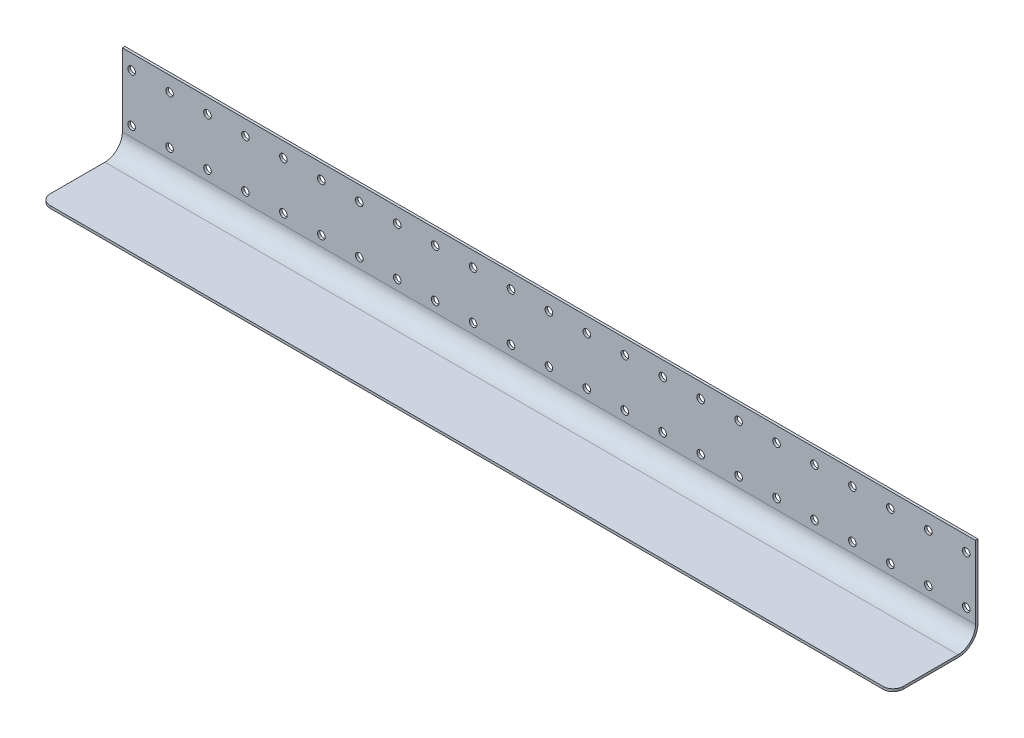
ISO-10303-21;
HEADER;
FILE_DESCRIPTION(('STEP AP214'),'2;1');
FILE_NAME('part.step','',(''),(''),'','','');
FILE_SCHEMA(('AUTOMOTIVE_DESIGN { 1 0 10303 214 1 1 1 1 }'));
ENDSEC;
DATA;
#1=APPLICATION_CONTEXT('core data for automotive mechanical design processes');
#2=APPLICATION_PROTOCOL_DEFINITION('international standard','automotive_design',2000,#1);
#3=PRODUCT_CONTEXT('',#1,'mechanical');
#4=PRODUCT('Part','Part','',(#3));
#5=PRODUCT_RELATED_PRODUCT_CATEGORY('part','',(#4));
#6=PRODUCT_DEFINITION_FORMATION('','',#4);
#7=PRODUCT_DEFINITION_CONTEXT('part definition',#1,'design');
#8=PRODUCT_DEFINITION('design','',#6,#7);
#9=PRODUCT_DEFINITION_SHAPE('','',#8);
#10=(LENGTH_UNIT() NAMED_UNIT(*) SI_UNIT(.MILLI.,.METRE.));
#11=(NAMED_UNIT(*) PLANE_ANGLE_UNIT() SI_UNIT($,.RADIAN.));
#12=(NAMED_UNIT(*) SI_UNIT($,.STERADIAN.) SOLID_ANGLE_UNIT());
#13=UNCERTAINTY_MEASURE_WITH_UNIT(LENGTH_MEASURE(1.E-05),#10,'distance_accuracy_value','');
#14=(GEOMETRIC_REPRESENTATION_CONTEXT(3) GLOBAL_UNCERTAINTY_ASSIGNED_CONTEXT((#13)) GLOBAL_UNIT_ASSIGNED_CONTEXT((#10,
#11,#12)) REPRESENTATION_CONTEXT('',''));
#15=CARTESIAN_POINT('',(0.,0.,0.));
#16=DIRECTION('',(0.,0.,1.));
#17=DIRECTION('',(1.,0.,0.));
#18=AXIS2_PLACEMENT_3D('',#15,#16,#17);
#19=CARTESIAN_POINT('',(609.4222,49.5299999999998,0.));
#20=DIRECTION('',(0.,0.,1.));
#21=DIRECTION('',(0.,-1.,0.));
#22=AXIS2_PLACEMENT_3D('',#19,#20,#21);
#23=PLANE('',#22);
#24=CARTESIAN_POINT('',(96.5199999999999,30.4800000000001,0.));
#25=DIRECTION('',(0.,0.,1.));
#26=DIRECTION('',(1.,0.,0.));
#27=AXIS2_PLACEMENT_3D('',#24,#25,#26);
#28=CIRCLE('',#27,4.82600000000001);
#29=CARTESIAN_POINT('',(101.346,30.4800000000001,0.));
#30=VERTEX_POINT('',#29);
#31=EDGE_CURVE('E557',#30,#30,#28,.T.);
#32=ORIENTED_EDGE('',*,*,#31,.T.);
#33=EDGE_LOOP('',(#32));
#34=FACE_BOUND('',#33,.T.);
#35=CARTESIAN_POINT('',(48.2600000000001,-30.4800000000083,0.));
#36=DIRECTION('',(0.,0.,1.));
#37=DIRECTION('',(1.,0.,0.));
#38=AXIS2_PLACEMENT_3D('',#35,#36,#37);
#39=CIRCLE('',#38,4.82600000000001);
#40=CARTESIAN_POINT('',(53.0860000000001,-30.4800000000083,0.));
#41=VERTEX_POINT('',#40);
#42=EDGE_CURVE('E558',#41,#41,#39,.T.);
#43=ORIENTED_EDGE('',*,*,#42,.T.);
#44=EDGE_LOOP('',(#43));
#45=FACE_BOUND('',#44,.T.);
#46=CARTESIAN_POINT('',(48.2599999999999,30.48,0.));
#47=DIRECTION('',(0.,0.,1.));
#48=DIRECTION('',(1.,0.,0.));
#49=AXIS2_PLACEMENT_3D('',#46,#47,#48);
#50=CIRCLE('',#49,4.82600000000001);
#51=CARTESIAN_POINT('',(53.0859999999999,30.48,0.));
#52=VERTEX_POINT('',#51);
#53=EDGE_CURVE('E552',#52,#52,#50,.T.);
#54=ORIENTED_EDGE('',*,*,#53,.T.);
#55=EDGE_LOOP('',(#54));
#56=FACE_BOUND('',#55,.T.);
#57=CARTESIAN_POINT('',(1.11022302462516E-13,-30.4800000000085,0.));
#58=DIRECTION('',(0.,0.,1.));
#59=DIRECTION('',(1.,0.,0.));
#60=AXIS2_PLACEMENT_3D('',#57,#58,#59);
#61=CIRCLE('',#60,4.82600000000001);
#62=CARTESIAN_POINT('',(4.82600000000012,-30.4800000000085,0.));
#63=VERTEX_POINT('',#62);
#64=EDGE_CURVE('E547',#63,#63,#61,.T.);
#65=ORIENTED_EDGE('',*,*,#64,.T.);
#66=EDGE_LOOP('',(#65));
#67=FACE_BOUND('',#66,.T.);
#68=CARTESIAN_POINT('',(193.04,30.4800000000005,0.));
#69=DIRECTION('',(0.,0.,1.));
#70=DIRECTION('',(1.,0.,0.));
#71=AXIS2_PLACEMENT_3D('',#68,#69,#70);
#72=CIRCLE('',#71,4.82600000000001);
#73=CARTESIAN_POINT('',(197.866,30.4800000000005,0.));
#74=VERTEX_POINT('',#73);
#75=EDGE_CURVE('E574',#74,#74,#72,.T.);
#76=ORIENTED_EDGE('',*,*,#75,.T.);
#77=EDGE_LOOP('',(#76));
#78=FACE_BOUND('',#77,.T.);
#79=CARTESIAN_POINT('',(144.78,-30.480000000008,0.));
#80=DIRECTION('',(0.,0.,1.));
#81=DIRECTION('',(1.,0.,0.));
#82=AXIS2_PLACEMENT_3D('',#79,#80,#81);
#83=CIRCLE('',#82,4.82600000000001);
#84=CARTESIAN_POINT('',(149.606,-30.480000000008,0.));
#85=VERTEX_POINT('',#84);
#86=EDGE_CURVE('E571',#85,#85,#83,.T.);
#87=ORIENTED_EDGE('',*,*,#86,.T.);
#88=EDGE_LOOP('',(#87));
#89=FACE_BOUND('',#88,.T.);
#90=CARTESIAN_POINT('',(144.78,30.4800000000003,0.));
#91=DIRECTION('',(0.,0.,1.));
#92=DIRECTION('',(1.,0.,0.));
#93=AXIS2_PLACEMENT_3D('',#90,#91,#92);
#94=CIRCLE('',#93,4.82600000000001);
#95=CARTESIAN_POINT('',(149.606,30.4800000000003,0.));
#96=VERTEX_POINT('',#95);
#97=EDGE_CURVE('E570',#96,#96,#94,.T.);
#98=ORIENTED_EDGE('',*,*,#97,.T.);
#99=EDGE_LOOP('',(#98));
#100=FACE_BOUND('',#99,.T.);
#101=CARTESIAN_POINT('',(96.5200000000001,-30.4800000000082,0.));
#102=DIRECTION('',(0.,0.,1.));
#103=DIRECTION('',(1.,0.,0.));
#104=AXIS2_PLACEMENT_3D('',#101,#102,#103);
#105=CIRCLE('',#104,4.82600000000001);
#106=CARTESIAN_POINT('',(101.346,-30.4800000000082,0.));
#107=VERTEX_POINT('',#106);
#108=EDGE_CURVE('E563',#107,#107,#105,.T.);
#109=ORIENTED_EDGE('',*,*,#108,.T.);
#110=EDGE_LOOP('',(#109));
#111=FACE_BOUND('',#110,.T.);
#112=CARTESIAN_POINT('',(-96.5200000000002,30.4799999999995,0.));
#113=DIRECTION('',(0.,0.,1.));
#114=DIRECTION('',(1.,0.,0.));
#115=AXIS2_PLACEMENT_3D('',#112,#113,#114);
#116=CIRCLE('',#115,4.82600000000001);
#117=CARTESIAN_POINT('',(-91.6940000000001,30.4799999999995,0.));
#118=VERTEX_POINT('',#117);
#119=EDGE_CURVE('E527',#118,#118,#116,.T.);
#120=ORIENTED_EDGE('',*,*,#119,.T.);
#121=EDGE_LOOP('',(#120));
#122=FACE_BOUND('',#121,.T.);
#123=CARTESIAN_POINT('',(-144.78,-30.480000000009,0.));
#124=DIRECTION('',(0.,0.,1.));
#125=DIRECTION('',(1.,0.,0.));
#126=AXIS2_PLACEMENT_3D('',#123,#124,#125);
#127=CIRCLE('',#126,4.82600000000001);
#128=CARTESIAN_POINT('',(-139.954,-30.480000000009,0.));
#129=VERTEX_POINT('',#128);
#130=EDGE_CURVE('E524',#129,#129,#127,.T.);
#131=ORIENTED_EDGE('',*,*,#130,.T.);
#132=EDGE_LOOP('',(#131));
#133=FACE_BOUND('',#132,.T.);
#134=CARTESIAN_POINT('',(-144.78,30.4799999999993,0.));
#135=DIRECTION('',(0.,0.,1.));
#136=DIRECTION('',(1.,0.,0.));
#137=AXIS2_PLACEMENT_3D('',#134,#135,#136);
#138=CIRCLE('',#137,4.82600000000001);
#139=CARTESIAN_POINT('',(-139.954,30.4799999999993,0.));
#140=VERTEX_POINT('',#139);
#141=EDGE_CURVE('E519',#140,#140,#138,.T.);
#142=ORIENTED_EDGE('',*,*,#141,.T.);
#143=EDGE_LOOP('',(#142));
#144=FACE_BOUND('',#143,.T.);
#145=CARTESIAN_POINT('',(-193.04,-30.4800000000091,0.));
#146=DIRECTION('',(0.,0.,1.));
#147=DIRECTION('',(1.,0.,0.));
#148=AXIS2_PLACEMENT_3D('',#145,#146,#147);
#149=CIRCLE('',#148,4.82600000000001);
#150=CARTESIAN_POINT('',(-188.214,-30.4800000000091,0.));
#151=VERTEX_POINT('',#150);
#152=EDGE_CURVE('E516',#151,#151,#149,.T.);
#153=ORIENTED_EDGE('',*,*,#152,.T.);
#154=EDGE_LOOP('',(#153));
#155=FACE_BOUND('',#154,.T.);
#156=CARTESIAN_POINT('',(-1.11022302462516E-13,30.4799999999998,0.));
#157=DIRECTION('',(0.,0.,1.));
#158=DIRECTION('',(1.,0.,0.));
#159=AXIS2_PLACEMENT_3D('',#156,#157,#158);
#160=CIRCLE('',#159,4.82600000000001);
#161=CARTESIAN_POINT('',(4.8259999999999,30.4799999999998,0.));
#162=VERTEX_POINT('',#161);
#163=EDGE_CURVE('E544',#162,#162,#160,.T.);
#164=ORIENTED_EDGE('',*,*,#163,.T.);
#165=EDGE_LOOP('',(#164));
#166=FACE_BOUND('',#165,.T.);
#167=CARTESIAN_POINT('',(-48.2599999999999,-30.4800000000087,0.));
#168=DIRECTION('',(0.,0.,1.));
#169=DIRECTION('',(1.,0.,0.));
#170=AXIS2_PLACEMENT_3D('',#167,#168,#169);
#171=CIRCLE('',#170,4.82600000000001);
#172=CARTESIAN_POINT('',(-43.4339999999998,-30.4800000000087,0.));
#173=VERTEX_POINT('',#172);
#174=EDGE_CURVE('E539',#173,#173,#171,.T.);
#175=ORIENTED_EDGE('',*,*,#174,.T.);
#176=EDGE_LOOP('',(#175));
#177=FACE_BOUND('',#176,.T.);
#178=CARTESIAN_POINT('',(-48.2600000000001,30.4799999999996,0.));
#179=DIRECTION('',(0.,0.,1.));
#180=DIRECTION('',(1.,0.,0.));
#181=AXIS2_PLACEMENT_3D('',#178,#179,#180);
#182=CIRCLE('',#181,4.82600000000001);
#183=CARTESIAN_POINT('',(-43.4340000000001,30.4799999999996,0.));
#184=VERTEX_POINT('',#183);
#185=EDGE_CURVE('E536',#184,#184,#182,.T.);
#186=ORIENTED_EDGE('',*,*,#185,.T.);
#187=EDGE_LOOP('',(#186));
#188=FACE_BOUND('',#187,.T.);
#189=CARTESIAN_POINT('',(-96.5199999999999,-30.4800000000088,0.));
#190=DIRECTION('',(0.,0.,1.));
#191=DIRECTION('',(1.,0.,0.));
#192=AXIS2_PLACEMENT_3D('',#189,#190,#191);
#193=CIRCLE('',#192,4.82600000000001);
#194=CARTESIAN_POINT('',(-91.6939999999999,-30.4800000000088,0.));
#195=VERTEX_POINT('',#194);
#196=EDGE_CURVE('E535',#195,#195,#193,.T.);
#197=ORIENTED_EDGE('',*,*,#196,.T.);
#198=EDGE_LOOP('',(#197));
#199=FACE_BOUND('',#198,.T.);
#200=CARTESIAN_POINT('',(482.6,30.4800000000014,0.));
#201=DIRECTION('',(0.,0.,1.));
#202=DIRECTION('',(1.,0.,0.));
#203=AXIS2_PLACEMENT_3D('',#200,#201,#202);
#204=CIRCLE('',#203,4.82600000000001);
#205=CARTESIAN_POINT('',(487.426,30.4800000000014,0.));
#206=VERTEX_POINT('',#205);
#207=EDGE_CURVE('E621',#206,#206,#204,.T.);
#208=ORIENTED_EDGE('',*,*,#207,.T.);
#209=EDGE_LOOP('',(#208));
#210=FACE_BOUND('',#209,.T.);
#211=CARTESIAN_POINT('',(434.34,-30.480000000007,0.));
#212=DIRECTION('',(0.,0.,1.));
#213=DIRECTION('',(1.,0.,0.));
#214=AXIS2_PLACEMENT_3D('',#211,#212,#213);
#215=CIRCLE('',#214,4.82600000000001);
#216=CARTESIAN_POINT('',(439.166,-30.480000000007,0.));
#217=VERTEX_POINT('',#216);
#218=EDGE_CURVE('E620',#217,#217,#215,.T.);
#219=ORIENTED_EDGE('',*,*,#218,.T.);
#220=EDGE_LOOP('',(#219));
#221=FACE_BOUND('',#220,.T.);
#222=CARTESIAN_POINT('',(434.34,30.4800000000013,0.));
#223=DIRECTION('',(0.,0.,1.));
#224=DIRECTION('',(1.,0.,0.));
#225=AXIS2_PLACEMENT_3D('',#222,#223,#224);
#226=CIRCLE('',#225,4.82600000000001);
#227=CARTESIAN_POINT('',(439.166,30.4800000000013,0.));
#228=VERTEX_POINT('',#227);
#229=EDGE_CURVE('E614',#228,#228,#226,.T.);
#230=ORIENTED_EDGE('',*,*,#229,.T.);
#231=EDGE_LOOP('',(#230));
#232=FACE_BOUND('',#231,.T.);
#233=CARTESIAN_POINT('',(386.08,-30.4800000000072,0.));
#234=DIRECTION('',(0.,0.,1.));
#235=DIRECTION('',(1.,0.,0.));
#236=AXIS2_PLACEMENT_3D('',#233,#234,#235);
#237=CIRCLE('',#236,4.82600000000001);
#238=CARTESIAN_POINT('',(390.906,-30.4800000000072,0.));
#239=VERTEX_POINT('',#238);
#240=EDGE_CURVE('E611',#239,#239,#237,.T.);
#241=ORIENTED_EDGE('',*,*,#240,.T.);
#242=EDGE_LOOP('',(#241));
#243=FACE_BOUND('',#242,.T.);
#244=CARTESIAN_POINT('',(530.86,-30.4800000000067,0.));
#245=DIRECTION('',(0.,0.,1.));
#246=DIRECTION('',(1.,0.,0.));
#247=AXIS2_PLACEMENT_3D('',#244,#245,#246);
#248=CIRCLE('',#247,4.82600000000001);
#249=CARTESIAN_POINT('',(535.686,-30.4800000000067,0.));
#250=VERTEX_POINT('',#249);
#251=EDGE_CURVE('E634',#250,#250,#248,.T.);
#252=ORIENTED_EDGE('',*,*,#251,.T.);
#253=EDGE_LOOP('',(#252));
#254=FACE_BOUND('',#253,.T.);
#255=CARTESIAN_POINT('',(530.86,30.4800000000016,0.));
#256=DIRECTION('',(0.,0.,1.));
#257=DIRECTION('',(1.,0.,0.));
#258=AXIS2_PLACEMENT_3D('',#255,#256,#257);
#259=CIRCLE('',#258,4.82600000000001);
#260=CARTESIAN_POINT('',(535.686,30.4800000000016,0.));
#261=VERTEX_POINT('',#260);
#262=EDGE_CURVE('E631',#261,#261,#259,.T.);
#263=ORIENTED_EDGE('',*,*,#262,.T.);
#264=EDGE_LOOP('',(#263));
#265=FACE_BOUND('',#264,.T.);
#266=CARTESIAN_POINT('',(482.6,-30.4800000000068,0.));
#267=DIRECTION('',(0.,0.,1.));
#268=DIRECTION('',(1.,0.,0.));
#269=AXIS2_PLACEMENT_3D('',#266,#267,#268);
#270=CIRCLE('',#269,4.82600000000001);
#271=CARTESIAN_POINT('',(487.426,-30.4800000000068,0.));
#272=VERTEX_POINT('',#271);
#273=EDGE_CURVE('E630',#272,#272,#270,.T.);
#274=ORIENTED_EDGE('',*,*,#273,.T.);
#275=EDGE_LOOP('',(#274));
#276=FACE_BOUND('',#275,.T.);
#277=CARTESIAN_POINT('',(289.56,30.4800000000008,0.));
#278=DIRECTION('',(0.,0.,1.));
#279=DIRECTION('',(1.,0.,0.));
#280=AXIS2_PLACEMENT_3D('',#277,#278,#279);
#281=CIRCLE('',#280,4.82600000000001);
#282=CARTESIAN_POINT('',(294.386,30.4800000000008,0.));
#283=VERTEX_POINT('',#282);
#284=EDGE_CURVE('E591',#283,#283,#281,.T.);
#285=ORIENTED_EDGE('',*,*,#284,.T.);
#286=EDGE_LOOP('',(#285));
#287=FACE_BOUND('',#286,.T.);
#288=CARTESIAN_POINT('',(241.3,-30.4800000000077,0.));
#289=DIRECTION('',(0.,0.,1.));
#290=DIRECTION('',(1.,0.,0.));
#291=AXIS2_PLACEMENT_3D('',#288,#289,#290);
#292=CIRCLE('',#291,4.82600000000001);
#293=CARTESIAN_POINT('',(246.126,-30.4800000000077,0.));
#294=VERTEX_POINT('',#293);
#295=EDGE_CURVE('E590',#294,#294,#292,.T.);
#296=ORIENTED_EDGE('',*,*,#295,.T.);
#297=EDGE_LOOP('',(#296));
#298=FACE_BOUND('',#297,.T.);
#299=CARTESIAN_POINT('',(241.3,30.4800000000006,0.));
#300=DIRECTION('',(0.,0.,1.));
#301=DIRECTION('',(1.,0.,0.));
#302=AXIS2_PLACEMENT_3D('',#299,#300,#301);
#303=CIRCLE('',#302,4.82600000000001);
#304=CARTESIAN_POINT('',(246.126,30.4800000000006,0.));
#305=VERTEX_POINT('',#304);
#306=EDGE_CURVE('E582',#305,#305,#303,.T.);
#307=ORIENTED_EDGE('',*,*,#306,.T.);
#308=EDGE_LOOP('',(#307));
#309=FACE_BOUND('',#308,.T.);
#310=CARTESIAN_POINT('',(193.04,-30.4800000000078,0.));
#311=DIRECTION('',(0.,0.,1.));
#312=DIRECTION('',(1.,0.,0.));
#313=AXIS2_PLACEMENT_3D('',#310,#311,#312);
#314=CIRCLE('',#313,4.82600000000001);
#315=CARTESIAN_POINT('',(197.866,-30.4800000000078,0.));
#316=VERTEX_POINT('',#315);
#317=EDGE_CURVE('E576',#316,#316,#314,.T.);
#318=ORIENTED_EDGE('',*,*,#317,.T.);
#319=EDGE_LOOP('',(#318));
#320=FACE_BOUND('',#319,.T.);
#321=CARTESIAN_POINT('',(386.08,30.4800000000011,0.));
#322=DIRECTION('',(0.,0.,1.));
#323=DIRECTION('',(1.,0.,0.));
#324=AXIS2_PLACEMENT_3D('',#321,#322,#323);
#325=CIRCLE('',#324,4.82600000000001);
#326=CARTESIAN_POINT('',(390.906,30.4800000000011,0.));
#327=VERTEX_POINT('',#326);
#328=EDGE_CURVE('E610',#327,#327,#325,.T.);
#329=ORIENTED_EDGE('',*,*,#328,.T.);
#330=EDGE_LOOP('',(#329));
#331=FACE_BOUND('',#330,.T.);
#332=CARTESIAN_POINT('',(337.82,-30.4800000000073,0.));
#333=DIRECTION('',(0.,0.,1.));
#334=DIRECTION('',(1.,0.,0.));
#335=AXIS2_PLACEMENT_3D('',#332,#333,#334);
#336=CIRCLE('',#335,4.82600000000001);
#337=CARTESIAN_POINT('',(342.646,-30.4800000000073,0.));
#338=VERTEX_POINT('',#337);
#339=EDGE_CURVE('E602',#338,#338,#336,.T.);
#340=ORIENTED_EDGE('',*,*,#339,.T.);
#341=EDGE_LOOP('',(#340));
#342=FACE_BOUND('',#341,.T.);
#343=CARTESIAN_POINT('',(337.82,30.4800000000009,0.));
#344=DIRECTION('',(0.,0.,1.));
#345=DIRECTION('',(1.,0.,0.));
#346=AXIS2_PLACEMENT_3D('',#343,#344,#345);
#347=CIRCLE('',#346,4.82600000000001);
#348=CARTESIAN_POINT('',(342.646,30.4800000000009,0.));
#349=VERTEX_POINT('',#348);
#350=EDGE_CURVE('E599',#349,#349,#347,.T.);
#351=ORIENTED_EDGE('',*,*,#350,.T.);
#352=EDGE_LOOP('',(#351));
#353=FACE_BOUND('',#352,.T.);
#354=CARTESIAN_POINT('',(289.56,-30.4800000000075,0.));
#355=DIRECTION('',(0.,0.,1.));
#356=DIRECTION('',(1.,0.,0.));
#357=AXIS2_PLACEMENT_3D('',#354,#355,#356);
#358=CIRCLE('',#357,4.82600000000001);
#359=CARTESIAN_POINT('',(294.386,-30.4800000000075,0.));
#360=VERTEX_POINT('',#359);
#361=EDGE_CURVE('E594',#360,#360,#358,.T.);
#362=ORIENTED_EDGE('',*,*,#361,.T.);
#363=EDGE_LOOP('',(#362));
#364=FACE_BOUND('',#363,.T.);
#365=CARTESIAN_POINT('',(-289.56,30.4799999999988,0.));
#366=DIRECTION('',(0.,0.,1.));
#367=DIRECTION('',(1.,0.,0.));
#368=AXIS2_PLACEMENT_3D('',#365,#366,#367);
#369=CIRCLE('',#368,4.82600000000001);
#370=CARTESIAN_POINT('',(-284.734,30.4799999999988,0.));
#371=VERTEX_POINT('',#370);
#372=EDGE_CURVE('E496',#371,#371,#369,.T.);
#373=ORIENTED_EDGE('',*,*,#372,.T.);
#374=EDGE_LOOP('',(#373));
#375=FACE_BOUND('',#374,.T.);
#376=CARTESIAN_POINT('',(-337.82,-30.4800000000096,0.));
#377=DIRECTION('',(0.,0.,1.));
#378=DIRECTION('',(1.,0.,0.));
#379=AXIS2_PLACEMENT_3D('',#376,#377,#378);
#380=CIRCLE('',#379,4.82600000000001);
#381=CARTESIAN_POINT('',(-332.994,-30.4800000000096,0.));
#382=VERTEX_POINT('',#381);
#383=EDGE_CURVE('E495',#382,#382,#380,.T.);
#384=ORIENTED_EDGE('',*,*,#383,.T.);
#385=EDGE_LOOP('',(#384));
#386=FACE_BOUND('',#385,.T.);
#387=CARTESIAN_POINT('',(-337.82,30.4799999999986,0.));
#388=DIRECTION('',(0.,0.,1.));
#389=DIRECTION('',(1.,0.,0.));
#390=AXIS2_PLACEMENT_3D('',#387,#388,#389);
#391=CIRCLE('',#390,4.82600000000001);
#392=CARTESIAN_POINT('',(-332.994,30.4799999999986,0.));
#393=VERTEX_POINT('',#392);
#394=EDGE_CURVE('E486',#393,#393,#391,.T.);
#395=ORIENTED_EDGE('',*,*,#394,.T.);
#396=EDGE_LOOP('',(#395));
#397=FACE_BOUND('',#396,.T.);
#398=CARTESIAN_POINT('',(-386.08,-30.4800000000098,0.));
#399=DIRECTION('',(0.,0.,1.));
#400=DIRECTION('',(1.,0.,0.));
#401=AXIS2_PLACEMENT_3D('',#398,#399,#400);
#402=CIRCLE('',#401,4.82600000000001);
#403=CARTESIAN_POINT('',(-381.254,-30.4800000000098,0.));
#404=VERTEX_POINT('',#403);
#405=EDGE_CURVE('E483',#404,#404,#402,.T.);
#406=ORIENTED_EDGE('',*,*,#405,.T.);
#407=EDGE_LOOP('',(#406));
#408=FACE_BOUND('',#407,.T.);
#409=CARTESIAN_POINT('',(-193.04,30.4799999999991,0.));
#410=DIRECTION('',(0.,0.,1.));
#411=DIRECTION('',(1.,0.,0.));
#412=AXIS2_PLACEMENT_3D('',#409,#410,#411);
#413=CIRCLE('',#412,4.82600000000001);
#414=CARTESIAN_POINT('',(-188.214,30.4799999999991,0.));
#415=VERTEX_POINT('',#414);
#416=EDGE_CURVE('E515',#415,#415,#413,.T.);
#417=ORIENTED_EDGE('',*,*,#416,.T.);
#418=EDGE_LOOP('',(#417));
#419=FACE_BOUND('',#418,.T.);
#420=CARTESIAN_POINT('',(-241.3,-30.4800000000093,0.));
#421=DIRECTION('',(0.,0.,1.));
#422=DIRECTION('',(1.,0.,0.));
#423=AXIS2_PLACEMENT_3D('',#420,#421,#422);
#424=CIRCLE('',#423,4.82600000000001);
#425=CARTESIAN_POINT('',(-236.474,-30.4800000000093,0.));
#426=VERTEX_POINT('',#425);
#427=EDGE_CURVE('E507',#426,#426,#424,.T.);
#428=ORIENTED_EDGE('',*,*,#427,.T.);
#429=EDGE_LOOP('',(#428));
#430=FACE_BOUND('',#429,.T.);
#431=CARTESIAN_POINT('',(-241.3,30.479999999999,0.));
#432=DIRECTION('',(0.,0.,1.));
#433=DIRECTION('',(1.,0.,0.));
#434=AXIS2_PLACEMENT_3D('',#431,#432,#433);
#435=CIRCLE('',#434,4.82600000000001);
#436=CARTESIAN_POINT('',(-236.474,30.479999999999,0.));
#437=VERTEX_POINT('',#436);
#438=EDGE_CURVE('E502',#437,#437,#435,.T.);
#439=ORIENTED_EDGE('',*,*,#438,.T.);
#440=EDGE_LOOP('',(#439));
#441=FACE_BOUND('',#440,.T.);
#442=CARTESIAN_POINT('',(-289.56,-30.4800000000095,0.));
#443=DIRECTION('',(0.,0.,1.));
#444=DIRECTION('',(1.,0.,0.));
#445=AXIS2_PLACEMENT_3D('',#442,#443,#444);
#446=CIRCLE('',#445,4.82600000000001);
#447=CARTESIAN_POINT('',(-284.734,-30.4800000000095,0.));
#448=VERTEX_POINT('',#447);
#449=EDGE_CURVE('E499',#448,#448,#446,.T.);
#450=ORIENTED_EDGE('',*,*,#449,.T.);
#451=EDGE_LOOP('',(#450));
#452=FACE_BOUND('',#451,.T.);
#453=CARTESIAN_POINT('',(-482.6,30.4799999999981,0.));
#454=DIRECTION('',(0.,0.,1.));
#455=DIRECTION('',(1.,0.,0.));
#456=AXIS2_PLACEMENT_3D('',#453,#454,#455);
#457=CIRCLE('',#456,4.82600000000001);
#458=CARTESIAN_POINT('',(-477.774,30.4799999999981,0.));
#459=VERTEX_POINT('',#458);
#460=EDGE_CURVE('E463',#459,#459,#457,.T.);
#461=ORIENTED_EDGE('',*,*,#460,.T.);
#462=EDGE_LOOP('',(#461));
#463=FACE_BOUND('',#462,.T.);
#464=CARTESIAN_POINT('',(-530.86,-30.4800000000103,0.));
#465=DIRECTION('',(0.,0.,1.));
#466=DIRECTION('',(1.,0.,0.));
#467=AXIS2_PLACEMENT_3D('',#464,#465,#466);
#468=CIRCLE('',#467,4.82600000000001);
#469=CARTESIAN_POINT('',(-526.034,-30.4800000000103,0.));
#470=VERTEX_POINT('',#469);
#471=EDGE_CURVE('E462',#470,#470,#468,.T.);
#472=ORIENTED_EDGE('',*,*,#471,.T.);
#473=EDGE_LOOP('',(#472));
#474=FACE_BOUND('',#473,.T.);
#475=CARTESIAN_POINT('',(-530.86,30.479999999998,0.));
#476=DIRECTION('',(0.,0.,1.));
#477=DIRECTION('',(1.,0.,0.));
#478=AXIS2_PLACEMENT_3D('',#475,#476,#477);
#479=CIRCLE('',#478,4.82600000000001);
#480=CARTESIAN_POINT('',(-526.034,30.479999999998,0.));
#481=VERTEX_POINT('',#480);
#482=EDGE_CURVE('E203',#481,#481,#479,.T.);
#483=ORIENTED_EDGE('',*,*,#482,.T.);
#484=EDGE_LOOP('',(#483));
#485=FACE_BOUND('',#484,.T.);
#486=CARTESIAN_POINT('',(-386.08,30.4799999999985,0.));
#487=DIRECTION('',(0.,0.,1.));
#488=DIRECTION('',(1.,0.,0.));
#489=AXIS2_PLACEMENT_3D('',#486,#487,#488);
#490=CIRCLE('',#489,4.82600000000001);
#491=CARTESIAN_POINT('',(-381.254,30.4799999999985,0.));
#492=VERTEX_POINT('',#491);
#493=EDGE_CURVE('E476',#492,#492,#490,.T.);
#494=ORIENTED_EDGE('',*,*,#493,.T.);
#495=EDGE_LOOP('',(#494));
#496=FACE_BOUND('',#495,.T.);
#497=CARTESIAN_POINT('',(-434.34,-30.48000000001,0.));
#498=DIRECTION('',(0.,0.,1.));
#499=DIRECTION('',(1.,0.,0.));
#500=AXIS2_PLACEMENT_3D('',#497,#498,#499);
#501=CIRCLE('',#500,4.82600000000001);
#502=CARTESIAN_POINT('',(-429.514,-30.48000000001,0.));
#503=VERTEX_POINT('',#502);
#504=EDGE_CURVE('E477',#503,#503,#501,.T.);
#505=ORIENTED_EDGE('',*,*,#504,.T.);
#506=EDGE_LOOP('',(#505));
#507=FACE_BOUND('',#506,.T.);
#508=CARTESIAN_POINT('',(-434.34,30.4799999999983,0.));
#509=DIRECTION('',(0.,0.,1.));
#510=DIRECTION('',(1.,0.,0.));
#511=AXIS2_PLACEMENT_3D('',#508,#509,#510);
#512=CIRCLE('',#511,4.82600000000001);
#513=CARTESIAN_POINT('',(-429.514,30.4799999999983,0.));
#514=VERTEX_POINT('',#513);
#515=EDGE_CURVE('E475',#514,#514,#512,.T.);
#516=ORIENTED_EDGE('',*,*,#515,.T.);
#517=EDGE_LOOP('',(#516));
#518=FACE_BOUND('',#517,.T.);
#519=CARTESIAN_POINT('',(-482.6,-30.4800000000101,0.));
#520=DIRECTION('',(0.,0.,1.));
#521=DIRECTION('',(1.,0.,0.));
#522=AXIS2_PLACEMENT_3D('',#519,#520,#521);
#523=CIRCLE('',#522,4.82600000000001);
#524=CARTESIAN_POINT('',(-477.774,-30.4800000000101,0.));
#525=VERTEX_POINT('',#524);
#526=EDGE_CURVE('E466',#525,#525,#523,.T.);
#527=ORIENTED_EDGE('',*,*,#526,.T.);
#528=EDGE_LOOP('',(#527));
#529=FACE_BOUND('',#528,.T.);
#530=DIRECTION('',(0.,-1.,0.));
#531=VECTOR('',#530,1.);
#532=CARTESIAN_POINT('',(-542.67588894,-181.460217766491,0.));
#533=LINE('',#532,#531);
#534=CARTESIAN_POINT('',(-542.67588894,49.5299999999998,0.));
#535=VERTEX_POINT('',#534);
#536=CARTESIAN_POINT('',(-542.67588894,-43.18,0.));
#537=VERTEX_POINT('',#536);
#538=EDGE_CURVE('E140',#535,#537,#533,.T.);
#539=ORIENTED_EDGE('',*,*,#538,.F.);
#540=DIRECTION('',(-1.,0.,0.));
#541=VECTOR('',#540,1.);
#542=CARTESIAN_POINT('',(609.4222,49.5299999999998,0.));
#543=LINE('',#542,#541);
#544=CARTESIAN_POINT('',(542.67588894,49.5299999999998,0.));
#545=VERTEX_POINT('',#544);
#546=EDGE_CURVE('E151',#545,#535,#543,.T.);
#547=ORIENTED_EDGE('',*,*,#546,.F.);
#548=DIRECTION('',(0.,1.,0.));
#549=VECTOR('',#548,1.);
#550=CARTESIAN_POINT('',(542.67588894,-181.460217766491,0.));
#551=LINE('',#550,#549);
#552=CARTESIAN_POINT('',(542.67588894,-43.18,0.));
#553=VERTEX_POINT('',#552);
#554=EDGE_CURVE('E175',#553,#545,#551,.T.);
#555=ORIENTED_EDGE('',*,*,#554,.F.);
#556=DIRECTION('',(-1.,0.,0.));
#557=VECTOR('',#556,1.);
#558=CARTESIAN_POINT('',(609.4222,-43.18,0.));
#559=LINE('',#558,#557);
#560=EDGE_CURVE('E147',#553,#537,#559,.T.);
#561=ORIENTED_EDGE('',*,*,#560,.T.);
#562=EDGE_LOOP('',(#539,#547,#555,#561));
#563=FACE_BOUND('',#562,.T.);
#564=ADVANCED_FACE('F44',(#34,#45,#56,#67,#78,#89,#100,#111,#122,#133,#144,#155,#166,#177,#188,
#199,#210,#221,#232,#243,#254,#265,#276,#287,#298,#309,#320,#331,#342,#353,#364,#375,#386,#397,
#408,#419,#430,#441,#452,#463,#474,#485,#496,#507,#518,#529,#563),#23,.F.);
#565=CARTESIAN_POINT('',(609.4222,49.5299999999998,3.175));
#566=DIRECTION('',(0.,-1.,0.));
#567=DIRECTION('',(0.,0.,-1.));
#568=AXIS2_PLACEMENT_3D('',#565,#566,#567);
#569=PLANE('',#568);
#570=DIRECTION('',(-1.,0.,0.));
#571=VECTOR('',#570,1.);
#572=CARTESIAN_POINT('',(609.4222,49.5299999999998,3.175));
#573=LINE('',#572,#571);
#574=CARTESIAN_POINT('',(542.67588894,49.5299999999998,3.175));
#575=VERTEX_POINT('',#574);
#576=CARTESIAN_POINT('',(-542.67588894,49.5299999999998,3.175));
#577=VERTEX_POINT('',#576);
#578=EDGE_CURVE('E165',#575,#577,#573,.T.);
#579=ORIENTED_EDGE('',*,*,#578,.F.);
#580=DIRECTION('',(0.,0.,-1.));
#581=VECTOR('',#580,1.);
#582=CARTESIAN_POINT('',(542.67588894,49.5299999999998,3.175));
#583=LINE('',#582,#581);
#584=EDGE_CURVE('E446',#575,#545,#583,.T.);
#585=ORIENTED_EDGE('',*,*,#584,.T.);
#586=ORIENTED_EDGE('',*,*,#546,.T.);
#587=DIRECTION('',(0.,0.,1.));
#588=VECTOR('',#587,1.);
#589=CARTESIAN_POINT('',(-542.67588894,49.5299999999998,3.175));
#590=LINE('',#589,#588);
#591=EDGE_CURVE('E876',#535,#577,#590,.T.);
#592=ORIENTED_EDGE('',*,*,#591,.T.);
#593=EDGE_LOOP('',(#579,#585,#586,#592));
#594=FACE_BOUND('',#593,.T.);
#595=ADVANCED_FACE('F219',(#594),#569,.F.);
#596=CARTESIAN_POINT('',(609.4222,49.5299999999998,3.175));
#597=DIRECTION('',(0.,0.,-1.));
#598=DIRECTION('',(0.,1.,0.));
#599=AXIS2_PLACEMENT_3D('',#596,#597,#598);
#600=PLANE('',#599);
#601=CARTESIAN_POINT('',(96.5199999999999,30.4800000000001,3.175));
#602=DIRECTION('',(0.,0.,-1.));
#603=DIRECTION('',(0.,1.,0.));
#604=AXIS2_PLACEMENT_3D('',#601,#602,#603);
#605=CIRCLE('',#604,4.82600000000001);
#606=CARTESIAN_POINT('',(96.5199999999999,35.3060000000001,3.175));
#607=VERTEX_POINT('',#606);
#608=EDGE_CURVE('E157',#607,#607,#605,.F.);
#609=ORIENTED_EDGE('',*,*,#608,.F.);
#610=EDGE_LOOP('',(#609));
#611=FACE_BOUND('',#610,.T.);
#612=CARTESIAN_POINT('',(48.2600000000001,-30.4800000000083,3.17499999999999));
#613=DIRECTION('',(0.,0.,-1.));
#614=DIRECTION('',(0.,1.,0.));
#615=AXIS2_PLACEMENT_3D('',#612,#613,#614);
#616=CIRCLE('',#615,4.82600000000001);
#617=CARTESIAN_POINT('',(48.2600000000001,-25.6540000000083,3.17499999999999));
#618=VERTEX_POINT('',#617);
#619=EDGE_CURVE('E253',#618,#618,#616,.F.);
#620=ORIENTED_EDGE('',*,*,#619,.F.);
#621=EDGE_LOOP('',(#620));
#622=FACE_BOUND('',#621,.T.);
#623=CARTESIAN_POINT('',(48.2599999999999,30.48,3.175));
#624=DIRECTION('',(0.,0.,-1.));
#625=DIRECTION('',(0.,1.,0.));
#626=AXIS2_PLACEMENT_3D('',#623,#624,#625);
#627=CIRCLE('',#626,4.82600000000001);
#628=CARTESIAN_POINT('',(48.2599999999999,35.306,3.175));
#629=VERTEX_POINT('',#628);
#630=EDGE_CURVE('E258',#629,#629,#627,.F.);
#631=ORIENTED_EDGE('',*,*,#630,.F.);
#632=EDGE_LOOP('',(#631));
#633=FACE_BOUND('',#632,.T.);
#634=CARTESIAN_POINT('',(1.11022302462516E-13,-30.4800000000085,3.17499999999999));
#635=DIRECTION('',(0.,0.,-1.));
#636=DIRECTION('',(0.,1.,0.));
#637=AXIS2_PLACEMENT_3D('',#634,#635,#636);
#638=CIRCLE('',#637,4.82600000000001);
#639=CARTESIAN_POINT('',(1.11022302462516E-13,-25.6540000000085,3.17499999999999));
#640=VERTEX_POINT('',#639);
#641=EDGE_CURVE('E263',#640,#640,#638,.F.);
#642=ORIENTED_EDGE('',*,*,#641,.F.);
#643=EDGE_LOOP('',(#642));
#644=FACE_BOUND('',#643,.T.);
#645=CARTESIAN_POINT('',(193.04,30.4800000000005,3.175));
#646=DIRECTION('',(0.,0.,-1.));
#647=DIRECTION('',(0.,1.,0.));
#648=AXIS2_PLACEMENT_3D('',#645,#646,#647);
#649=CIRCLE('',#648,4.82600000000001);
#650=CARTESIAN_POINT('',(193.04,35.3060000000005,3.175));
#651=VERTEX_POINT('',#650);
#652=EDGE_CURVE('E270',#651,#651,#649,.F.);
#653=ORIENTED_EDGE('',*,*,#652,.F.);
#654=EDGE_LOOP('',(#653));
#655=FACE_BOUND('',#654,.T.);
#656=CARTESIAN_POINT('',(144.78,-30.480000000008,3.17499999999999));
#657=DIRECTION('',(0.,0.,-1.));
#658=DIRECTION('',(0.,1.,0.));
#659=AXIS2_PLACEMENT_3D('',#656,#657,#658);
#660=CIRCLE('',#659,4.82600000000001);
#661=CARTESIAN_POINT('',(144.78,-25.654000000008,3.17499999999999));
#662=VERTEX_POINT('',#661);
#663=EDGE_CURVE('E272',#662,#662,#660,.F.);
#664=ORIENTED_EDGE('',*,*,#663,.F.);
#665=EDGE_LOOP('',(#664));
#666=FACE_BOUND('',#665,.T.);
#667=CARTESIAN_POINT('',(144.78,30.4800000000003,3.175));
#668=DIRECTION('',(0.,0.,-1.));
#669=DIRECTION('',(0.,1.,0.));
#670=AXIS2_PLACEMENT_3D('',#667,#668,#669);
#671=CIRCLE('',#670,4.82600000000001);
#672=CARTESIAN_POINT('',(144.78,35.3060000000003,3.175));
#673=VERTEX_POINT('',#672);
#674=EDGE_CURVE('E273',#673,#673,#671,.F.);
#675=ORIENTED_EDGE('',*,*,#674,.F.);
#676=EDGE_LOOP('',(#675));
#677=FACE_BOUND('',#676,.T.);
#678=CARTESIAN_POINT('',(96.5200000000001,-30.4800000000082,3.17499999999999));
#679=DIRECTION('',(0.,0.,-1.));
#680=DIRECTION('',(0.,1.,0.));
#681=AXIS2_PLACEMENT_3D('',#678,#679,#680);
#682=CIRCLE('',#681,4.82600000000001);
#683=CARTESIAN_POINT('',(96.5200000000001,-25.6540000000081,3.17499999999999));
#684=VERTEX_POINT('',#683);
#685=EDGE_CURVE('E278',#684,#684,#682,.F.);
#686=ORIENTED_EDGE('',*,*,#685,.F.);
#687=EDGE_LOOP('',(#686));
#688=FACE_BOUND('',#687,.T.);
#689=CARTESIAN_POINT('',(-96.5200000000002,30.4799999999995,3.175));
#690=DIRECTION('',(0.,0.,-1.));
#691=DIRECTION('',(0.,1.,0.));
#692=AXIS2_PLACEMENT_3D('',#689,#690,#691);
#693=CIRCLE('',#692,4.82600000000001);
#694=CARTESIAN_POINT('',(-96.5200000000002,35.3059999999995,3.175));
#695=VERTEX_POINT('',#694);
#696=EDGE_CURVE('E283',#695,#695,#693,.F.);
#697=ORIENTED_EDGE('',*,*,#696,.F.);
#698=EDGE_LOOP('',(#697));
#699=FACE_BOUND('',#698,.T.);
#700=CARTESIAN_POINT('',(-144.78,-30.480000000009,3.17499999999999));
#701=DIRECTION('',(0.,0.,-1.));
#702=DIRECTION('',(0.,1.,0.));
#703=AXIS2_PLACEMENT_3D('',#700,#701,#702);
#704=CIRCLE('',#703,4.82600000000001);
#705=CARTESIAN_POINT('',(-144.78,-25.654000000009,3.17499999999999));
#706=VERTEX_POINT('',#705);
#707=EDGE_CURVE('E290',#706,#706,#704,.F.);
#708=ORIENTED_EDGE('',*,*,#707,.F.);
#709=EDGE_LOOP('',(#708));
#710=FACE_BOUND('',#709,.T.);
#711=CARTESIAN_POINT('',(-144.78,30.4799999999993,3.175));
#712=DIRECTION('',(0.,0.,-1.));
#713=DIRECTION('',(0.,1.,0.));
#714=AXIS2_PLACEMENT_3D('',#711,#712,#713);
#715=CIRCLE('',#714,4.82600000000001);
#716=CARTESIAN_POINT('',(-144.78,35.3059999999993,3.175));
#717=VERTEX_POINT('',#716);
#718=EDGE_CURVE('E293',#717,#717,#715,.F.);
#719=ORIENTED_EDGE('',*,*,#718,.F.);
#720=EDGE_LOOP('',(#719));
#721=FACE_BOUND('',#720,.T.);
#722=CARTESIAN_POINT('',(-193.04,-30.4800000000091,3.17499999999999));
#723=DIRECTION('',(0.,0.,-1.));
#724=DIRECTION('',(0.,1.,0.));
#725=AXIS2_PLACEMENT_3D('',#722,#723,#724);
#726=CIRCLE('',#725,4.82600000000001);
#727=CARTESIAN_POINT('',(-193.04,-25.6540000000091,3.17499999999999));
#728=VERTEX_POINT('',#727);
#729=EDGE_CURVE('E294',#728,#728,#726,.F.);
#730=ORIENTED_EDGE('',*,*,#729,.F.);
#731=EDGE_LOOP('',(#730));
#732=FACE_BOUND('',#731,.T.);
#733=CARTESIAN_POINT('',(-1.11022302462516E-13,30.4799999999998,3.175));
#734=DIRECTION('',(0.,0.,-1.));
#735=DIRECTION('',(0.,1.,0.));
#736=AXIS2_PLACEMENT_3D('',#733,#734,#735);
#737=CIRCLE('',#736,4.82600000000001);
#738=CARTESIAN_POINT('',(-1.11022302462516E-13,35.3059999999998,3.175));
#739=VERTEX_POINT('',#738);
#740=EDGE_CURVE('E299',#739,#739,#737,.F.);
#741=ORIENTED_EDGE('',*,*,#740,.F.);
#742=EDGE_LOOP('',(#741));
#743=FACE_BOUND('',#742,.T.);
#744=CARTESIAN_POINT('',(-48.2599999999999,-30.4800000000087,3.17499999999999));
#745=DIRECTION('',(0.,0.,-1.));
#746=DIRECTION('',(0.,1.,0.));
#747=AXIS2_PLACEMENT_3D('',#744,#745,#746);
#748=CIRCLE('',#747,4.82600000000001);
#749=CARTESIAN_POINT('',(-48.2599999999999,-25.6540000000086,3.17499999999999));
#750=VERTEX_POINT('',#749);
#751=EDGE_CURVE('E303',#750,#750,#748,.F.);
#752=ORIENTED_EDGE('',*,*,#751,.F.);
#753=EDGE_LOOP('',(#752));
#754=FACE_BOUND('',#753,.T.);
#755=CARTESIAN_POINT('',(-48.2600000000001,30.4799999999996,3.175));
#756=DIRECTION('',(0.,0.,-1.));
#757=DIRECTION('',(0.,1.,0.));
#758=AXIS2_PLACEMENT_3D('',#755,#756,#757);
#759=CIRCLE('',#758,4.82600000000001);
#760=CARTESIAN_POINT('',(-48.2600000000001,35.3059999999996,3.175));
#761=VERTEX_POINT('',#760);
#762=EDGE_CURVE('E310',#761,#761,#759,.F.);
#763=ORIENTED_EDGE('',*,*,#762,.F.);
#764=EDGE_LOOP('',(#763));
#765=FACE_BOUND('',#764,.T.);
#766=CARTESIAN_POINT('',(-96.5199999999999,-30.4800000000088,3.17499999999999));
#767=DIRECTION('',(0.,0.,-1.));
#768=DIRECTION('',(0.,1.,0.));
#769=AXIS2_PLACEMENT_3D('',#766,#767,#768);
#770=CIRCLE('',#769,4.82600000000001);
#771=CARTESIAN_POINT('',(-96.5199999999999,-25.6540000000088,3.17499999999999));
#772=VERTEX_POINT('',#771);
#773=EDGE_CURVE('E311',#772,#772,#770,.F.);
#774=ORIENTED_EDGE('',*,*,#773,.F.);
#775=EDGE_LOOP('',(#774));
#776=FACE_BOUND('',#775,.T.);
#777=CARTESIAN_POINT('',(482.6,30.4800000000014,3.175));
#778=DIRECTION('',(0.,0.,-1.));
#779=DIRECTION('',(0.,1.,0.));
#780=AXIS2_PLACEMENT_3D('',#777,#778,#779);
#781=CIRCLE('',#780,4.82600000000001);
#782=CARTESIAN_POINT('',(482.6,35.3060000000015,3.175));
#783=VERTEX_POINT('',#782);
#784=EDGE_CURVE('E314',#783,#783,#781,.F.);
#785=ORIENTED_EDGE('',*,*,#784,.F.);
#786=EDGE_LOOP('',(#785));
#787=FACE_BOUND('',#786,.T.);
#788=CARTESIAN_POINT('',(434.34,-30.480000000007,3.17499999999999));
#789=DIRECTION('',(0.,0.,-1.));
#790=DIRECTION('',(0.,1.,0.));
#791=AXIS2_PLACEMENT_3D('',#788,#789,#790);
#792=CIRCLE('',#791,4.82600000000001);
#793=CARTESIAN_POINT('',(434.34,-25.654000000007,3.17499999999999));
#794=VERTEX_POINT('',#793);
#795=EDGE_CURVE('E316',#794,#794,#792,.F.);
#796=ORIENTED_EDGE('',*,*,#795,.F.);
#797=EDGE_LOOP('',(#796));
#798=FACE_BOUND('',#797,.T.);
#799=CARTESIAN_POINT('',(434.34,30.4800000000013,3.175));
#800=DIRECTION('',(0.,0.,-1.));
#801=DIRECTION('',(0.,1.,0.));
#802=AXIS2_PLACEMENT_3D('',#799,#800,#801);
#803=CIRCLE('',#802,4.82600000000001);
#804=CARTESIAN_POINT('',(434.34,35.3060000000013,3.175));
#805=VERTEX_POINT('',#804);
#806=EDGE_CURVE('E322',#805,#805,#803,.F.);
#807=ORIENTED_EDGE('',*,*,#806,.F.);
#808=EDGE_LOOP('',(#807));
#809=FACE_BOUND('',#808,.T.);
#810=CARTESIAN_POINT('',(386.08,-30.4800000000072,3.17499999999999));
#811=DIRECTION('',(0.,0.,-1.));
#812=DIRECTION('',(0.,1.,0.));
#813=AXIS2_PLACEMENT_3D('',#810,#811,#812);
#814=CIRCLE('',#813,4.82600000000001);
#815=CARTESIAN_POINT('',(386.08,-25.6540000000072,3.17499999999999));
#816=VERTEX_POINT('',#815);
#817=EDGE_CURVE('E330',#816,#816,#814,.F.);
#818=ORIENTED_EDGE('',*,*,#817,.F.);
#819=EDGE_LOOP('',(#818));
#820=FACE_BOUND('',#819,.T.);
#821=CARTESIAN_POINT('',(530.86,-30.4800000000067,3.17499999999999));
#822=DIRECTION('',(0.,0.,-1.));
#823=DIRECTION('',(0.,1.,0.));
#824=AXIS2_PLACEMENT_3D('',#821,#822,#823);
#825=CIRCLE('',#824,4.82600000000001);
#826=CARTESIAN_POINT('',(530.86,-25.6540000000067,3.17499999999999));
#827=VERTEX_POINT('',#826);
#828=EDGE_CURVE('E331',#827,#827,#825,.F.);
#829=ORIENTED_EDGE('',*,*,#828,.F.);
#830=EDGE_LOOP('',(#829));
#831=FACE_BOUND('',#830,.T.);
#832=CARTESIAN_POINT('',(530.86,30.4800000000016,3.175));
#833=DIRECTION('',(0.,0.,-1.));
#834=DIRECTION('',(0.,1.,0.));
#835=AXIS2_PLACEMENT_3D('',#832,#833,#834);
#836=CIRCLE('',#835,4.82600000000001);
#837=CARTESIAN_POINT('',(530.86,35.3060000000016,3.175));
#838=VERTEX_POINT('',#837);
#839=EDGE_CURVE('E334',#838,#838,#836,.F.);
#840=ORIENTED_EDGE('',*,*,#839,.F.);
#841=EDGE_LOOP('',(#840));
#842=FACE_BOUND('',#841,.T.);
#843=CARTESIAN_POINT('',(482.6,-30.4800000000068,3.17499999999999));
#844=DIRECTION('',(0.,0.,-1.));
#845=DIRECTION('',(0.,1.,0.));
#846=AXIS2_PLACEMENT_3D('',#843,#844,#845);
#847=CIRCLE('',#846,4.82600000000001);
#848=CARTESIAN_POINT('',(482.6,-25.6540000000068,3.17499999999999));
#849=VERTEX_POINT('',#848);
#850=EDGE_CURVE('E339',#849,#849,#847,.F.);
#851=ORIENTED_EDGE('',*,*,#850,.F.);
#852=EDGE_LOOP('',(#851));
#853=FACE_BOUND('',#852,.T.);
#854=CARTESIAN_POINT('',(289.56,30.4800000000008,3.175));
#855=DIRECTION('',(0.,0.,-1.));
#856=DIRECTION('',(0.,1.,0.));
#857=AXIS2_PLACEMENT_3D('',#854,#855,#856);
#858=CIRCLE('',#857,4.82600000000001);
#859=CARTESIAN_POINT('',(289.56,35.3060000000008,3.175));
#860=VERTEX_POINT('',#859);
#861=EDGE_CURVE('E342',#860,#860,#858,.F.);
#862=ORIENTED_EDGE('',*,*,#861,.F.);
#863=EDGE_LOOP('',(#862));
#864=FACE_BOUND('',#863,.T.);
#865=CARTESIAN_POINT('',(241.3,-30.4800000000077,3.17499999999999));
#866=DIRECTION('',(0.,0.,-1.));
#867=DIRECTION('',(0.,1.,0.));
#868=AXIS2_PLACEMENT_3D('',#865,#866,#867);
#869=CIRCLE('',#868,4.82600000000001);
#870=CARTESIAN_POINT('',(241.3,-25.6540000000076,3.17499999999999));
#871=VERTEX_POINT('',#870);
#872=EDGE_CURVE('E350',#871,#871,#869,.F.);
#873=ORIENTED_EDGE('',*,*,#872,.F.);
#874=EDGE_LOOP('',(#873));
#875=FACE_BOUND('',#874,.T.);
#876=CARTESIAN_POINT('',(241.3,30.4800000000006,3.175));
#877=DIRECTION('',(0.,0.,-1.));
#878=DIRECTION('',(0.,1.,0.));
#879=AXIS2_PLACEMENT_3D('',#876,#877,#878);
#880=CIRCLE('',#879,4.82600000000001);
#881=CARTESIAN_POINT('',(241.3,35.3060000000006,3.175));
#882=VERTEX_POINT('',#881);
#883=EDGE_CURVE('E351',#882,#882,#880,.F.);
#884=ORIENTED_EDGE('',*,*,#883,.F.);
#885=EDGE_LOOP('',(#884));
#886=FACE_BOUND('',#885,.T.);
#887=CARTESIAN_POINT('',(193.04,-30.4800000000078,3.17499999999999));
#888=DIRECTION('',(0.,0.,-1.));
#889=DIRECTION('',(0.,1.,0.));
#890=AXIS2_PLACEMENT_3D('',#887,#888,#889);
#891=CIRCLE('',#890,4.82600000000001);
#892=CARTESIAN_POINT('',(193.04,-25.6540000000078,3.17499999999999));
#893=VERTEX_POINT('',#892);
#894=EDGE_CURVE('E354',#893,#893,#891,.F.);
#895=ORIENTED_EDGE('',*,*,#894,.F.);
#896=EDGE_LOOP('',(#895));
#897=FACE_BOUND('',#896,.T.);
#898=CARTESIAN_POINT('',(386.08,30.4800000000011,3.175));
#899=DIRECTION('',(0.,0.,-1.));
#900=DIRECTION('',(0.,1.,0.));
#901=AXIS2_PLACEMENT_3D('',#898,#899,#900);
#902=CIRCLE('',#901,4.82600000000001);
#903=CARTESIAN_POINT('',(386.08,35.3060000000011,3.175));
#904=VERTEX_POINT('',#903);
#905=EDGE_CURVE('E360',#904,#904,#902,.F.);
#906=ORIENTED_EDGE('',*,*,#905,.F.);
#907=EDGE_LOOP('',(#906));
#908=FACE_BOUND('',#907,.T.);
#909=CARTESIAN_POINT('',(337.82,-30.4800000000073,3.17499999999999));
#910=DIRECTION('',(0.,0.,-1.));
#911=DIRECTION('',(0.,1.,0.));
#912=AXIS2_PLACEMENT_3D('',#909,#910,#911);
#913=CIRCLE('',#912,4.82600000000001);
#914=CARTESIAN_POINT('',(337.82,-25.6540000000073,3.17499999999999));
#915=VERTEX_POINT('',#914);
#916=EDGE_CURVE('E361',#915,#915,#913,.F.);
#917=ORIENTED_EDGE('',*,*,#916,.F.);
#918=EDGE_LOOP('',(#917));
#919=FACE_BOUND('',#918,.T.);
#920=CARTESIAN_POINT('',(337.82,30.4800000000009,3.175));
#921=DIRECTION('',(0.,0.,-1.));
#922=DIRECTION('',(0.,1.,0.));
#923=AXIS2_PLACEMENT_3D('',#920,#921,#922);
#924=CIRCLE('',#923,4.82600000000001);
#925=CARTESIAN_POINT('',(337.82,35.306000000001,3.175));
#926=VERTEX_POINT('',#925);
#927=EDGE_CURVE('E370',#926,#926,#924,.F.);
#928=ORIENTED_EDGE('',*,*,#927,.F.);
#929=EDGE_LOOP('',(#928));
#930=FACE_BOUND('',#929,.T.);
#931=CARTESIAN_POINT('',(289.56,-30.4800000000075,3.17499999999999));
#932=DIRECTION('',(0.,0.,-1.));
#933=DIRECTION('',(0.,1.,0.));
#934=AXIS2_PLACEMENT_3D('',#931,#932,#933);
#935=CIRCLE('',#934,4.82600000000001);
#936=CARTESIAN_POINT('',(289.56,-25.6540000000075,3.17499999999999));
#937=VERTEX_POINT('',#936);
#938=EDGE_CURVE('E371',#937,#937,#935,.F.);
#939=ORIENTED_EDGE('',*,*,#938,.F.);
#940=EDGE_LOOP('',(#939));
#941=FACE_BOUND('',#940,.T.);
#942=CARTESIAN_POINT('',(-289.56,30.4799999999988,3.175));
#943=DIRECTION('',(0.,0.,-1.));
#944=DIRECTION('',(0.,1.,0.));
#945=AXIS2_PLACEMENT_3D('',#942,#943,#944);
#946=CIRCLE('',#945,4.82600000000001);
#947=CARTESIAN_POINT('',(-289.56,35.3059999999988,3.175));
#948=VERTEX_POINT('',#947);
#949=EDGE_CURVE('E374',#948,#948,#946,.F.);
#950=ORIENTED_EDGE('',*,*,#949,.F.);
#951=EDGE_LOOP('',(#950));
#952=FACE_BOUND('',#951,.T.);
#953=CARTESIAN_POINT('',(-337.82,-30.4800000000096,3.17499999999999));
#954=DIRECTION('',(0.,0.,-1.));
#955=DIRECTION('',(0.,1.,0.));
#956=AXIS2_PLACEMENT_3D('',#953,#954,#955);
#957=CIRCLE('',#956,4.82600000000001);
#958=CARTESIAN_POINT('',(-337.82,-25.6540000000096,3.17499999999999));
#959=VERTEX_POINT('',#958);
#960=EDGE_CURVE('E378',#959,#959,#957,.F.);
#961=ORIENTED_EDGE('',*,*,#960,.F.);
#962=EDGE_LOOP('',(#961));
#963=FACE_BOUND('',#962,.T.);
#964=CARTESIAN_POINT('',(-337.82,30.4799999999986,3.175));
#965=DIRECTION('',(0.,0.,-1.));
#966=DIRECTION('',(0.,1.,0.));
#967=AXIS2_PLACEMENT_3D('',#964,#965,#966);
#968=CIRCLE('',#967,4.82600000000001);
#969=CARTESIAN_POINT('',(-337.82,35.3059999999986,3.175));
#970=VERTEX_POINT('',#969);
#971=EDGE_CURVE('E384',#970,#970,#968,.F.);
#972=ORIENTED_EDGE('',*,*,#971,.F.);
#973=EDGE_LOOP('',(#972));
#974=FACE_BOUND('',#973,.T.);
#975=CARTESIAN_POINT('',(-386.08,-30.4800000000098,3.17499999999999));
#976=DIRECTION('',(0.,0.,-1.));
#977=DIRECTION('',(0.,1.,0.));
#978=AXIS2_PLACEMENT_3D('',#975,#976,#977);
#979=CIRCLE('',#978,4.82600000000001);
#980=CARTESIAN_POINT('',(-386.08,-25.6540000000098,3.17499999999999));
#981=VERTEX_POINT('',#980);
#982=EDGE_CURVE('E390',#981,#981,#979,.F.);
#983=ORIENTED_EDGE('',*,*,#982,.F.);
#984=EDGE_LOOP('',(#983));
#985=FACE_BOUND('',#984,.T.);
#986=CARTESIAN_POINT('',(-193.04,30.4799999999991,3.175));
#987=DIRECTION('',(0.,0.,-1.));
#988=DIRECTION('',(0.,1.,0.));
#989=AXIS2_PLACEMENT_3D('',#986,#987,#988);
#990=CIRCLE('',#989,4.82600000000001);
#991=CARTESIAN_POINT('',(-193.04,35.3059999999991,3.175));
#992=VERTEX_POINT('',#991);
#993=EDGE_CURVE('E392',#992,#992,#990,.F.);
#994=ORIENTED_EDGE('',*,*,#993,.F.);
#995=EDGE_LOOP('',(#994));
#996=FACE_BOUND('',#995,.T.);
#997=CARTESIAN_POINT('',(-241.3,-30.4800000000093,3.17499999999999));
#998=DIRECTION('',(0.,0.,-1.));
#999=DIRECTION('',(0.,1.,0.));
#1000=AXIS2_PLACEMENT_3D('',#997,#998,#999);
#1001=CIRCLE('',#1000,4.82600000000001);
#1002=CARTESIAN_POINT('',(-241.3,-25.6540000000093,3.17499999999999));
#1003=VERTEX_POINT('',#1002);
#1004=EDGE_CURVE('E391',#1003,#1003,#1001,.F.);
#1005=ORIENTED_EDGE('',*,*,#1004,.F.);
#1006=EDGE_LOOP('',(#1005));
#1007=FACE_BOUND('',#1006,.T.);
#1008=CARTESIAN_POINT('',(-241.3,30.479999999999,3.175));
#1009=DIRECTION('',(0.,0.,-1.));
#1010=DIRECTION('',(0.,1.,0.));
#1011=AXIS2_PLACEMENT_3D('',#1008,#1009,#1010);
#1012=CIRCLE('',#1011,4.82600000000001);
#1013=CARTESIAN_POINT('',(-241.3,35.305999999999,3.175));
#1014=VERTEX_POINT('',#1013);
#1015=EDGE_CURVE('E398',#1014,#1014,#1012,.F.);
#1016=ORIENTED_EDGE('',*,*,#1015,.F.);
#1017=EDGE_LOOP('',(#1016));
#1018=FACE_BOUND('',#1017,.T.);
#1019=CARTESIAN_POINT('',(-289.56,-30.4800000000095,3.17499999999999));
#1020=DIRECTION('',(0.,0.,-1.));
#1021=DIRECTION('',(0.,1.,0.));
#1022=AXIS2_PLACEMENT_3D('',#1019,#1020,#1021);
#1023=CIRCLE('',#1022,4.82600000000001);
#1024=CARTESIAN_POINT('',(-289.56,-25.6540000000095,3.17499999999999));
#1025=VERTEX_POINT('',#1024);
#1026=EDGE_CURVE('E401',#1025,#1025,#1023,.F.);
#1027=ORIENTED_EDGE('',*,*,#1026,.F.);
#1028=EDGE_LOOP('',(#1027));
#1029=FACE_BOUND('',#1028,.T.);
#1030=CARTESIAN_POINT('',(-482.6,30.4799999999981,3.175));
#1031=DIRECTION('',(0.,0.,-1.));
#1032=DIRECTION('',(0.,1.,0.));
#1033=AXIS2_PLACEMENT_3D('',#1030,#1031,#1032);
#1034=CIRCLE('',#1033,4.82600000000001);
#1035=CARTESIAN_POINT('',(-482.6,35.3059999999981,3.175));
#1036=VERTEX_POINT('',#1035);
#1037=EDGE_CURVE('E410',#1036,#1036,#1034,.F.);
#1038=ORIENTED_EDGE('',*,*,#1037,.F.);
#1039=EDGE_LOOP('',(#1038));
#1040=FACE_BOUND('',#1039,.T.);
#1041=CARTESIAN_POINT('',(-530.86,-30.4800000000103,3.17499999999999));
#1042=DIRECTION('',(0.,0.,-1.));
#1043=DIRECTION('',(0.,1.,0.));
#1044=AXIS2_PLACEMENT_3D('',#1041,#1042,#1043);
#1045=CIRCLE('',#1044,4.82600000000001);
#1046=CARTESIAN_POINT('',(-530.86,-25.6540000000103,3.17499999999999));
#1047=VERTEX_POINT('',#1046);
#1048=EDGE_CURVE('E412',#1047,#1047,#1045,.F.);
#1049=ORIENTED_EDGE('',*,*,#1048,.F.);
#1050=EDGE_LOOP('',(#1049));
#1051=FACE_BOUND('',#1050,.T.);
#1052=CARTESIAN_POINT('',(-530.86,30.479999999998,3.175));
#1053=DIRECTION('',(0.,0.,-1.));
#1054=DIRECTION('',(0.,1.,0.));
#1055=AXIS2_PLACEMENT_3D('',#1052,#1053,#1054);
#1056=CIRCLE('',#1055,4.82600000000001);
#1057=CARTESIAN_POINT('',(-530.86,35.305999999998,3.175));
#1058=VERTEX_POINT('',#1057);
#1059=EDGE_CURVE('E411',#1058,#1058,#1056,.F.);
#1060=ORIENTED_EDGE('',*,*,#1059,.F.);
#1061=EDGE_LOOP('',(#1060));
#1062=FACE_BOUND('',#1061,.T.);
#1063=CARTESIAN_POINT('',(-386.08,30.4799999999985,3.175));
#1064=DIRECTION('',(0.,0.,-1.));
#1065=DIRECTION('',(0.,1.,0.));
#1066=AXIS2_PLACEMENT_3D('',#1063,#1064,#1065);
#1067=CIRCLE('',#1066,4.82600000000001);
#1068=CARTESIAN_POINT('',(-386.08,35.3059999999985,3.175));
#1069=VERTEX_POINT('',#1068);
#1070=EDGE_CURVE('E418',#1069,#1069,#1067,.F.);
#1071=ORIENTED_EDGE('',*,*,#1070,.F.);
#1072=EDGE_LOOP('',(#1071));
#1073=FACE_BOUND('',#1072,.T.);
#1074=CARTESIAN_POINT('',(-434.34,-30.48000000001,3.17499999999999));
#1075=DIRECTION('',(0.,0.,-1.));
#1076=DIRECTION('',(0.,1.,0.));
#1077=AXIS2_PLACEMENT_3D('',#1074,#1075,#1076);
#1078=CIRCLE('',#1077,4.82600000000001);
#1079=CARTESIAN_POINT('',(-434.34,-25.65400000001,3.17499999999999));
#1080=VERTEX_POINT('',#1079);
#1081=EDGE_CURVE('E421',#1080,#1080,#1078,.F.);
#1082=ORIENTED_EDGE('',*,*,#1081,.F.);
#1083=EDGE_LOOP('',(#1082));
#1084=FACE_BOUND('',#1083,.T.);
#1085=CARTESIAN_POINT('',(-434.34,30.4799999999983,3.175));
#1086=DIRECTION('',(0.,0.,-1.));
#1087=DIRECTION('',(0.,1.,0.));
#1088=AXIS2_PLACEMENT_3D('',#1085,#1086,#1087);
#1089=CIRCLE('',#1088,4.82600000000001);
#1090=CARTESIAN_POINT('',(-434.34,35.3059999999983,3.175));
#1091=VERTEX_POINT('',#1090);
#1092=EDGE_CURVE('E430',#1091,#1091,#1089,.F.);
#1093=ORIENTED_EDGE('',*,*,#1092,.F.);
#1094=EDGE_LOOP('',(#1093));
#1095=FACE_BOUND('',#1094,.T.);
#1096=CARTESIAN_POINT('',(-482.6,-30.4800000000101,3.17499999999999));
#1097=DIRECTION('',(0.,0.,-1.));
#1098=DIRECTION('',(0.,1.,0.));
#1099=AXIS2_PLACEMENT_3D('',#1096,#1097,#1098);
#1100=CIRCLE('',#1099,4.82600000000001);
#1101=CARTESIAN_POINT('',(-482.6,-25.6540000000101,3.17499999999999));
#1102=VERTEX_POINT('',#1101);
#1103=EDGE_CURVE('E431',#1102,#1102,#1100,.F.);
#1104=ORIENTED_EDGE('',*,*,#1103,.F.);
#1105=EDGE_LOOP('',(#1104));
#1106=FACE_BOUND('',#1105,.T.);
#1107=DIRECTION('',(-1.,0.,0.));
#1108=VECTOR('',#1107,1.);
#1109=CARTESIAN_POINT('',(609.4222,-43.18,3.17499999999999));
#1110=LINE('',#1109,#1108);
#1111=CARTESIAN_POINT('',(542.67588894,-43.18,3.17499999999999));
#1112=VERTEX_POINT('',#1111);
#1113=CARTESIAN_POINT('',(-542.67588894,-43.18,3.17499999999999));
#1114=VERTEX_POINT('',#1113);
#1115=EDGE_CURVE('E153',#1112,#1114,#1110,.T.);
#1116=ORIENTED_EDGE('',*,*,#1115,.F.);
#1117=DIRECTION('',(0.,1.,0.));
#1118=VECTOR('',#1117,1.);
#1119=CARTESIAN_POINT('',(542.67588894,49.5299999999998,3.175));
#1120=LINE('',#1119,#1118);
#1121=EDGE_CURVE('E434',#1112,#575,#1120,.T.);
#1122=ORIENTED_EDGE('',*,*,#1121,.T.);
#1123=ORIENTED_EDGE('',*,*,#578,.T.);
#1124=DIRECTION('',(0.,-1.,0.));
#1125=VECTOR('',#1124,1.);
#1126=CARTESIAN_POINT('',(-542.67588894,49.5299999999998,3.175));
#1127=LINE('',#1126,#1125);
#1128=EDGE_CURVE('E440',#577,#1114,#1127,.T.);
#1129=ORIENTED_EDGE('',*,*,#1128,.T.);
#1130=EDGE_LOOP('',(#1116,#1122,#1123,#1129));
#1131=FACE_BOUND('',#1130,.T.);
#1132=ADVANCED_FACE('F228',(#611,#622,#633,#644,#655,#666,#677,#688,#699,#710,#721,#732,#743,
#754,#765,#776,#787,#798,#809,#820,#831,#842,#853,#864,#875,#886,#897,#908,#919,#930,#941,#952,
#963,#974,#985,#996,#1007,#1018,#1029,#1040,#1051,#1062,#1073,#1084,#1095,#1106,#1131),#600,.F.);
#1133=CARTESIAN_POINT('',(609.4222,-43.18,25.4));
#1134=DIRECTION('',(-1.,0.,0.));
#1135=DIRECTION('',(0.,0.,1.));
#1136=AXIS2_PLACEMENT_3D('',#1133,#1134,#1135);
#1137=CYLINDRICAL_SURFACE('',#1136,22.225);
#1138=DIRECTION('',(-1.,0.,0.));
#1139=VECTOR('',#1138,1.);
#1140=CARTESIAN_POINT('',(609.4222,-65.405,25.4));
#1141=LINE('',#1140,#1139);
#1142=CARTESIAN_POINT('',(542.67588894,-65.405,25.4));
#1143=VERTEX_POINT('',#1142);
#1144=CARTESIAN_POINT('',(-542.67588894,-65.405,25.4));
#1145=VERTEX_POINT('',#1144);
#1146=EDGE_CURVE('E150',#1143,#1145,#1141,.T.);
#1147=ORIENTED_EDGE('',*,*,#1146,.F.);
#1148=CARTESIAN_POINT('',(542.67588894,-43.18,25.4));
#1149=DIRECTION('',(-1.,0.,0.));
#1150=DIRECTION('',(0.,0.,1.));
#1151=AXIS2_PLACEMENT_3D('',#1148,#1149,#1150);
#1152=CIRCLE('',#1151,22.225);
#1153=EDGE_CURVE('E442',#1143,#1112,#1152,.F.);
#1154=ORIENTED_EDGE('',*,*,#1153,.T.);
#1155=ORIENTED_EDGE('',*,*,#1115,.T.);
#1156=CARTESIAN_POINT('',(-542.67588894,-43.18,25.4));
#1157=DIRECTION('',(1.,0.,0.));
#1158=DIRECTION('',(0.,0.,-1.));
#1159=AXIS2_PLACEMENT_3D('',#1156,#1157,#1158);
#1160=CIRCLE('',#1159,22.225);
#1161=EDGE_CURVE('E441',#1114,#1145,#1160,.F.);
#1162=ORIENTED_EDGE('',*,*,#1161,.T.);
#1163=EDGE_LOOP('',(#1147,#1154,#1155,#1162));
#1164=FACE_BOUND('',#1163,.T.);
#1165=ADVANCED_FACE('F241',(#1164),#1137,.F.);
#1166=CARTESIAN_POINT('',(609.4222,-65.405,25.4));
#1167=DIRECTION('',(0.,-1.,0.));
#1168=DIRECTION('',(0.,0.,-1.));
#1169=AXIS2_PLACEMENT_3D('',#1166,#1167,#1168);
#1170=PLANE('',#1169);
#1171=DIRECTION('',(0.,0.,1.));
#1172=VECTOR('',#1171,1.);
#1173=CARTESIAN_POINT('',(-542.67588894,-65.405,25.4));
#1174=LINE('',#1173,#1172);
#1175=CARTESIAN_POINT('',(-542.67588894,-65.405,94.95));
#1176=VERTEX_POINT('',#1175);
#1177=EDGE_CURVE('E132',#1145,#1176,#1174,.T.);
#1178=ORIENTED_EDGE('',*,*,#1177,.T.);
#1179=CARTESIAN_POINT('',(-529.67588894,-65.405,94.95));
#1180=DIRECTION('',(0.,-1.,0.));
#1181=DIRECTION('',(0.,0.,-1.));
#1182=AXIS2_PLACEMENT_3D('',#1179,#1180,#1181);
#1183=CIRCLE('',#1182,13.);
#1184=CARTESIAN_POINT('',(-529.67588894,-65.405,107.95));
#1185=VERTEX_POINT('',#1184);
#1186=EDGE_CURVE('E53',#1176,#1185,#1183,.F.);
#1187=ORIENTED_EDGE('',*,*,#1186,.T.);
#1188=DIRECTION('',(1.,0.,0.));
#1189=VECTOR('',#1188,1.);
#1190=CARTESIAN_POINT('',(609.4222,-65.405,107.95));
#1191=LINE('',#1190,#1189);
#1192=CARTESIAN_POINT('',(529.67588894,-65.405,107.95));
#1193=VERTEX_POINT('',#1192);
#1194=EDGE_CURVE('E197',#1185,#1193,#1191,.T.);
#1195=ORIENTED_EDGE('',*,*,#1194,.T.);
#1196=CARTESIAN_POINT('',(529.67588894,-65.405,94.95));
#1197=DIRECTION('',(0.,-1.,0.));
#1198=DIRECTION('',(0.,0.,-1.));
#1199=AXIS2_PLACEMENT_3D('',#1196,#1197,#1198);
#1200=CIRCLE('',#1199,13.);
#1201=CARTESIAN_POINT('',(542.67588894,-65.405,94.95));
#1202=VERTEX_POINT('',#1201);
#1203=EDGE_CURVE('E61',#1193,#1202,#1200,.F.);
#1204=ORIENTED_EDGE('',*,*,#1203,.T.);
#1205=DIRECTION('',(0.,0.,-1.));
#1206=VECTOR('',#1205,1.);
#1207=CARTESIAN_POINT('',(542.67588894,-65.405,25.4));
#1208=LINE('',#1207,#1206);
#1209=EDGE_CURVE('E444',#1202,#1143,#1208,.T.);
#1210=ORIENTED_EDGE('',*,*,#1209,.T.);
#1211=ORIENTED_EDGE('',*,*,#1146,.T.);
#1212=EDGE_LOOP('',(#1178,#1187,#1195,#1204,#1210,#1211));
#1213=FACE_BOUND('',#1212,.T.);
#1214=ADVANCED_FACE('F194',(#1213),#1170,.F.);
#1215=CARTESIAN_POINT('',(609.4222,-68.58,25.4));
#1216=DIRECTION('',(0.,1.,0.));
#1217=DIRECTION('',(0.,0.,1.));
#1218=AXIS2_PLACEMENT_3D('',#1215,#1216,#1217);
#1219=PLANE('',#1218);
#1220=DIRECTION('',(-1.,0.,0.));
#1221=VECTOR('',#1220,1.);
#1222=CARTESIAN_POINT('',(659.746470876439,-68.58,107.95));
#1223=LINE('',#1222,#1221);
#1224=CARTESIAN_POINT('',(529.67588894,-68.58,107.95));
#1225=VERTEX_POINT('',#1224);
#1226=CARTESIAN_POINT('',(-529.67588894,-68.58,107.95));
#1227=VERTEX_POINT('',#1226);
#1228=EDGE_CURVE('E204',#1225,#1227,#1223,.T.);
#1229=ORIENTED_EDGE('',*,*,#1228,.T.);
#1230=CARTESIAN_POINT('',(-529.67588894,-68.58,94.95));
#1231=DIRECTION('',(0.,1.,0.));
#1232=DIRECTION('',(0.,0.,1.));
#1233=AXIS2_PLACEMENT_3D('',#1230,#1231,#1232);
#1234=CIRCLE('',#1233,13.);
#1235=CARTESIAN_POINT('',(-542.67588894,-68.58,94.95));
#1236=VERTEX_POINT('',#1235);
#1237=EDGE_CURVE('E128',#1227,#1236,#1234,.F.);
#1238=ORIENTED_EDGE('',*,*,#1237,.T.);
#1239=DIRECTION('',(0.,0.,-1.));
#1240=VECTOR('',#1239,1.);
#1241=CARTESIAN_POINT('',(-542.67588894,-68.58,25.4));
#1242=LINE('',#1241,#1240);
#1243=CARTESIAN_POINT('',(-542.67588894,-68.58,25.4));
#1244=VERTEX_POINT('',#1243);
#1245=EDGE_CURVE('E125',#1236,#1244,#1242,.T.);
#1246=ORIENTED_EDGE('',*,*,#1245,.T.);
#1247=DIRECTION('',(-1.,0.,0.));
#1248=VECTOR('',#1247,1.);
#1249=CARTESIAN_POINT('',(609.4222,-68.58,25.4));
#1250=LINE('',#1249,#1248);
#1251=CARTESIAN_POINT('',(542.67588894,-68.58,25.4));
#1252=VERTEX_POINT('',#1251);
#1253=EDGE_CURVE('E127',#1252,#1244,#1250,.T.);
#1254=ORIENTED_EDGE('',*,*,#1253,.F.);
#1255=DIRECTION('',(0.,0.,1.));
#1256=VECTOR('',#1255,1.);
#1257=CARTESIAN_POINT('',(542.67588894,-68.58,25.4));
#1258=LINE('',#1257,#1256);
#1259=CARTESIAN_POINT('',(542.67588894,-68.58,94.95));
#1260=VERTEX_POINT('',#1259);
#1261=EDGE_CURVE('E451',#1252,#1260,#1258,.T.);
#1262=ORIENTED_EDGE('',*,*,#1261,.T.);
#1263=CARTESIAN_POINT('',(529.67588894,-68.58,94.95));
#1264=DIRECTION('',(0.,1.,0.));
#1265=DIRECTION('',(0.,0.,1.));
#1266=AXIS2_PLACEMENT_3D('',#1263,#1264,#1265);
#1267=CIRCLE('',#1266,13.);
#1268=EDGE_CURVE('E183',#1260,#1225,#1267,.F.);
#1269=ORIENTED_EDGE('',*,*,#1268,.T.);
#1270=EDGE_LOOP('',(#1229,#1238,#1246,#1254,#1262,#1269));
#1271=FACE_BOUND('',#1270,.T.);
#1272=ADVANCED_FACE('F123',(#1271),#1219,.F.);
#1273=CARTESIAN_POINT('',(609.4222,-43.18,25.4));
#1274=DIRECTION('',(-1.,0.,0.));
#1275=DIRECTION('',(0.,0.,1.));
#1276=AXIS2_PLACEMENT_3D('',#1273,#1274,#1275);
#1277=CYLINDRICAL_SURFACE('',#1276,25.4);
#1278=ORIENTED_EDGE('',*,*,#560,.F.);
#1279=CARTESIAN_POINT('',(542.67588894,-43.18,25.4));
#1280=DIRECTION('',(-1.,0.,0.));
#1281=DIRECTION('',(0.,0.,1.));
#1282=AXIS2_PLACEMENT_3D('',#1279,#1280,#1281);
#1283=CIRCLE('',#1282,25.4);
#1284=EDGE_CURVE('E143',#553,#1252,#1283,.T.);
#1285=ORIENTED_EDGE('',*,*,#1284,.T.);
#1286=ORIENTED_EDGE('',*,*,#1253,.T.);
#1287=CARTESIAN_POINT('',(-542.67588894,-43.18,25.4));
#1288=DIRECTION('',(1.,0.,0.));
#1289=DIRECTION('',(0.,0.,-1.));
#1290=AXIS2_PLACEMENT_3D('',#1287,#1288,#1289);
#1291=CIRCLE('',#1290,25.4);
#1292=EDGE_CURVE('E135',#1244,#537,#1291,.T.);
#1293=ORIENTED_EDGE('',*,*,#1292,.T.);
#1294=EDGE_LOOP('',(#1278,#1285,#1286,#1293));
#1295=FACE_BOUND('',#1294,.T.);
#1296=ADVANCED_FACE('F144',(#1295),#1277,.T.);
#1297=CARTESIAN_POINT('',(-482.6,-30.4800000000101,10.));
#1298=DIRECTION('',(0.,0.,-1.));
#1299=DIRECTION('',(-1.,0.,0.));
#1300=AXIS2_PLACEMENT_3D('',#1297,#1298,#1299);
#1301=CYLINDRICAL_SURFACE('',#1300,4.82600000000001);
#1302=ORIENTED_EDGE('',*,*,#526,.F.);
#1303=EDGE_LOOP('',(#1302));
#1304=FACE_BOUND('',#1303,.T.);
#1305=ORIENTED_EDGE('',*,*,#1103,.T.);
#1306=EDGE_LOOP('',(#1305));
#1307=FACE_BOUND('',#1306,.T.);
#1308=ADVANCED_FACE('F236',(#1304,#1307),#1301,.F.);
#1309=CARTESIAN_POINT('',(-434.34,30.4799999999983,10.));
#1310=DIRECTION('',(0.,0.,-1.));
#1311=DIRECTION('',(-1.,0.,0.));
#1312=AXIS2_PLACEMENT_3D('',#1309,#1310,#1311);
#1313=CYLINDRICAL_SURFACE('',#1312,4.82600000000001);
#1314=ORIENTED_EDGE('',*,*,#515,.F.);
#1315=EDGE_LOOP('',(#1314));
#1316=FACE_BOUND('',#1315,.T.);
#1317=ORIENTED_EDGE('',*,*,#1092,.T.);
#1318=EDGE_LOOP('',(#1317));
#1319=FACE_BOUND('',#1318,.T.);
#1320=ADVANCED_FACE('F894',(#1316,#1319),#1313,.F.);
#1321=CARTESIAN_POINT('',(-434.34,-30.48000000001,10.));
#1322=DIRECTION('',(0.,0.,-1.));
#1323=DIRECTION('',(-1.,0.,0.));
#1324=AXIS2_PLACEMENT_3D('',#1321,#1322,#1323);
#1325=CYLINDRICAL_SURFACE('',#1324,4.82600000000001);
#1326=ORIENTED_EDGE('',*,*,#504,.F.);
#1327=EDGE_LOOP('',(#1326));
#1328=FACE_BOUND('',#1327,.T.);
#1329=ORIENTED_EDGE('',*,*,#1081,.T.);
#1330=EDGE_LOOP('',(#1329));
#1331=FACE_BOUND('',#1330,.T.);
#1332=ADVANCED_FACE('F899',(#1328,#1331),#1325,.F.);
#1333=CARTESIAN_POINT('',(-386.08,30.4799999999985,10.));
#1334=DIRECTION('',(0.,0.,-1.));
#1335=DIRECTION('',(-1.,0.,0.));
#1336=AXIS2_PLACEMENT_3D('',#1333,#1334,#1335);
#1337=CYLINDRICAL_SURFACE('',#1336,4.82600000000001);
#1338=ORIENTED_EDGE('',*,*,#493,.F.);
#1339=EDGE_LOOP('',(#1338));
#1340=FACE_BOUND('',#1339,.T.);
#1341=ORIENTED_EDGE('',*,*,#1070,.T.);
#1342=EDGE_LOOP('',(#1341));
#1343=FACE_BOUND('',#1342,.T.);
#1344=ADVANCED_FACE('F903',(#1340,#1343),#1337,.F.);
#1345=CARTESIAN_POINT('',(-530.86,30.479999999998,10.));
#1346=DIRECTION('',(0.,0.,-1.));
#1347=DIRECTION('',(-1.,0.,0.));
#1348=AXIS2_PLACEMENT_3D('',#1345,#1346,#1347);
#1349=CYLINDRICAL_SURFACE('',#1348,4.82600000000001);
#1350=ORIENTED_EDGE('',*,*,#482,.F.);
#1351=EDGE_LOOP('',(#1350));
#1352=FACE_BOUND('',#1351,.T.);
#1353=ORIENTED_EDGE('',*,*,#1059,.T.);
#1354=EDGE_LOOP('',(#1353));
#1355=FACE_BOUND('',#1354,.T.);
#1356=ADVANCED_FACE('F907',(#1352,#1355),#1349,.F.);
#1357=CARTESIAN_POINT('',(-530.86,-30.4800000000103,10.));
#1358=DIRECTION('',(0.,0.,-1.));
#1359=DIRECTION('',(-1.,0.,0.));
#1360=AXIS2_PLACEMENT_3D('',#1357,#1358,#1359);
#1361=CYLINDRICAL_SURFACE('',#1360,4.82600000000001);
#1362=ORIENTED_EDGE('',*,*,#471,.F.);
#1363=EDGE_LOOP('',(#1362));
#1364=FACE_BOUND('',#1363,.T.);
#1365=ORIENTED_EDGE('',*,*,#1048,.T.);
#1366=EDGE_LOOP('',(#1365));
#1367=FACE_BOUND('',#1366,.T.);
#1368=ADVANCED_FACE('F1168',(#1364,#1367),#1361,.F.);
#1369=CARTESIAN_POINT('',(-482.6,30.4799999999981,10.));
#1370=DIRECTION('',(0.,0.,-1.));
#1371=DIRECTION('',(-1.,0.,0.));
#1372=AXIS2_PLACEMENT_3D('',#1369,#1370,#1371);
#1373=CYLINDRICAL_SURFACE('',#1372,4.82600000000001);
#1374=ORIENTED_EDGE('',*,*,#460,.F.);
#1375=EDGE_LOOP('',(#1374));
#1376=FACE_BOUND('',#1375,.T.);
#1377=ORIENTED_EDGE('',*,*,#1037,.T.);
#1378=EDGE_LOOP('',(#1377));
#1379=FACE_BOUND('',#1378,.T.);
#1380=ADVANCED_FACE('F940',(#1376,#1379),#1373,.F.);
#1381=CARTESIAN_POINT('',(-289.56,-30.4800000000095,10.));
#1382=DIRECTION('',(0.,0.,-1.));
#1383=DIRECTION('',(-1.,0.,0.));
#1384=AXIS2_PLACEMENT_3D('',#1381,#1382,#1383);
#1385=CYLINDRICAL_SURFACE('',#1384,4.82600000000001);
#1386=ORIENTED_EDGE('',*,*,#449,.F.);
#1387=EDGE_LOOP('',(#1386));
#1388=FACE_BOUND('',#1387,.T.);
#1389=ORIENTED_EDGE('',*,*,#1026,.T.);
#1390=EDGE_LOOP('',(#1389));
#1391=FACE_BOUND('',#1390,.T.);
#1392=ADVANCED_FACE('F933',(#1388,#1391),#1385,.F.);
#1393=CARTESIAN_POINT('',(-241.3,30.479999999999,10.));
#1394=DIRECTION('',(0.,0.,-1.));
#1395=DIRECTION('',(-1.,0.,0.));
#1396=AXIS2_PLACEMENT_3D('',#1393,#1394,#1395);
#1397=CYLINDRICAL_SURFACE('',#1396,4.82600000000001);
#1398=ORIENTED_EDGE('',*,*,#438,.F.);
#1399=EDGE_LOOP('',(#1398));
#1400=FACE_BOUND('',#1399,.T.);
#1401=ORIENTED_EDGE('',*,*,#1015,.T.);
#1402=EDGE_LOOP('',(#1401));
#1403=FACE_BOUND('',#1402,.T.);
#1404=ADVANCED_FACE('F928',(#1400,#1403),#1397,.F.);
#1405=CARTESIAN_POINT('',(-241.3,-30.4800000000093,10.));
#1406=DIRECTION('',(0.,0.,-1.));
#1407=DIRECTION('',(-1.,0.,0.));
#1408=AXIS2_PLACEMENT_3D('',#1405,#1406,#1407);
#1409=CYLINDRICAL_SURFACE('',#1408,4.82600000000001);
#1410=ORIENTED_EDGE('',*,*,#427,.F.);
#1411=EDGE_LOOP('',(#1410));
#1412=FACE_BOUND('',#1411,.T.);
#1413=ORIENTED_EDGE('',*,*,#1004,.T.);
#1414=EDGE_LOOP('',(#1413));
#1415=FACE_BOUND('',#1414,.T.);
#1416=ADVANCED_FACE('F935',(#1412,#1415),#1409,.F.);
#1417=CARTESIAN_POINT('',(-193.04,30.4799999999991,10.));
#1418=DIRECTION('',(0.,0.,-1.));
#1419=DIRECTION('',(-1.,0.,0.));
#1420=AXIS2_PLACEMENT_3D('',#1417,#1418,#1419);
#1421=CYLINDRICAL_SURFACE('',#1420,4.82600000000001);
#1422=ORIENTED_EDGE('',*,*,#416,.F.);
#1423=EDGE_LOOP('',(#1422));
#1424=FACE_BOUND('',#1423,.T.);
#1425=ORIENTED_EDGE('',*,*,#993,.T.);
#1426=EDGE_LOOP('',(#1425));
#1427=FACE_BOUND('',#1426,.T.);
#1428=ADVANCED_FACE('F922',(#1424,#1427),#1421,.F.);
#1429=CARTESIAN_POINT('',(-386.08,-30.4800000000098,10.));
#1430=DIRECTION('',(0.,0.,-1.));
#1431=DIRECTION('',(-1.,0.,0.));
#1432=AXIS2_PLACEMENT_3D('',#1429,#1430,#1431);
#1433=CYLINDRICAL_SURFACE('',#1432,4.82600000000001);
#1434=ORIENTED_EDGE('',*,*,#405,.F.);
#1435=EDGE_LOOP('',(#1434));
#1436=FACE_BOUND('',#1435,.T.);
#1437=ORIENTED_EDGE('',*,*,#982,.T.);
#1438=EDGE_LOOP('',(#1437));
#1439=FACE_BOUND('',#1438,.T.);
#1440=ADVANCED_FACE('F920',(#1436,#1439),#1433,.F.);
#1441=CARTESIAN_POINT('',(-337.82,30.4799999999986,10.));
#1442=DIRECTION('',(0.,0.,-1.));
#1443=DIRECTION('',(-1.,0.,0.));
#1444=AXIS2_PLACEMENT_3D('',#1441,#1442,#1443);
#1445=CYLINDRICAL_SURFACE('',#1444,4.82600000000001);
#1446=ORIENTED_EDGE('',*,*,#394,.F.);
#1447=EDGE_LOOP('',(#1446));
#1448=FACE_BOUND('',#1447,.T.);
#1449=ORIENTED_EDGE('',*,*,#971,.T.);
#1450=EDGE_LOOP('',(#1449));
#1451=FACE_BOUND('',#1450,.T.);
#1452=ADVANCED_FACE('F913',(#1448,#1451),#1445,.F.);
#1453=CARTESIAN_POINT('',(-337.82,-30.4800000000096,10.));
#1454=DIRECTION('',(0.,0.,-1.));
#1455=DIRECTION('',(-1.,0.,0.));
#1456=AXIS2_PLACEMENT_3D('',#1453,#1454,#1455);
#1457=CYLINDRICAL_SURFACE('',#1456,4.82600000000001);
#1458=ORIENTED_EDGE('',*,*,#383,.F.);
#1459=EDGE_LOOP('',(#1458));
#1460=FACE_BOUND('',#1459,.T.);
#1461=ORIENTED_EDGE('',*,*,#960,.T.);
#1462=EDGE_LOOP('',(#1461));
#1463=FACE_BOUND('',#1462,.T.);
#1464=ADVANCED_FACE('F916',(#1460,#1463),#1457,.F.);
#1465=CARTESIAN_POINT('',(-289.56,30.4799999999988,10.));
#1466=DIRECTION('',(0.,0.,-1.));
#1467=DIRECTION('',(-1.,0.,0.));
#1468=AXIS2_PLACEMENT_3D('',#1465,#1466,#1467);
#1469=CYLINDRICAL_SURFACE('',#1468,4.82600000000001);
#1470=ORIENTED_EDGE('',*,*,#372,.F.);
#1471=EDGE_LOOP('',(#1470));
#1472=FACE_BOUND('',#1471,.T.);
#1473=ORIENTED_EDGE('',*,*,#949,.T.);
#1474=EDGE_LOOP('',(#1473));
#1475=FACE_BOUND('',#1474,.T.);
#1476=ADVANCED_FACE('F791',(#1472,#1475),#1469,.F.);
#1477=CARTESIAN_POINT('',(289.56,-30.4800000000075,10.));
#1478=DIRECTION('',(0.,0.,-1.));
#1479=DIRECTION('',(-1.,0.,0.));
#1480=AXIS2_PLACEMENT_3D('',#1477,#1478,#1479);
#1481=CYLINDRICAL_SURFACE('',#1480,4.82600000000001);
#1482=ORIENTED_EDGE('',*,*,#361,.F.);
#1483=EDGE_LOOP('',(#1482));
#1484=FACE_BOUND('',#1483,.T.);
#1485=ORIENTED_EDGE('',*,*,#938,.T.);
#1486=EDGE_LOOP('',(#1485));
#1487=FACE_BOUND('',#1486,.T.);
#1488=ADVANCED_FACE('F788',(#1484,#1487),#1481,.F.);
#1489=CARTESIAN_POINT('',(337.82,30.4800000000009,10.));
#1490=DIRECTION('',(0.,0.,-1.));
#1491=DIRECTION('',(-1.,0.,0.));
#1492=AXIS2_PLACEMENT_3D('',#1489,#1490,#1491);
#1493=CYLINDRICAL_SURFACE('',#1492,4.82600000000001);
#1494=ORIENTED_EDGE('',*,*,#350,.F.);
#1495=EDGE_LOOP('',(#1494));
#1496=FACE_BOUND('',#1495,.T.);
#1497=ORIENTED_EDGE('',*,*,#927,.T.);
#1498=EDGE_LOOP('',(#1497));
#1499=FACE_BOUND('',#1498,.T.);
#1500=ADVANCED_FACE('F781',(#1496,#1499),#1493,.F.);
#1501=CARTESIAN_POINT('',(337.82,-30.4800000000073,10.));
#1502=DIRECTION('',(0.,0.,-1.));
#1503=DIRECTION('',(-1.,0.,0.));
#1504=AXIS2_PLACEMENT_3D('',#1501,#1502,#1503);
#1505=CYLINDRICAL_SURFACE('',#1504,4.82600000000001);
#1506=ORIENTED_EDGE('',*,*,#339,.F.);
#1507=EDGE_LOOP('',(#1506));
#1508=FACE_BOUND('',#1507,.T.);
#1509=ORIENTED_EDGE('',*,*,#916,.T.);
#1510=EDGE_LOOP('',(#1509));
#1511=FACE_BOUND('',#1510,.T.);
#1512=ADVANCED_FACE('F787',(#1508,#1511),#1505,.F.);
#1513=CARTESIAN_POINT('',(386.08,30.4800000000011,10.));
#1514=DIRECTION('',(0.,0.,-1.));
#1515=DIRECTION('',(-1.,0.,0.));
#1516=AXIS2_PLACEMENT_3D('',#1513,#1514,#1515);
#1517=CYLINDRICAL_SURFACE('',#1516,4.82600000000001);
#1518=ORIENTED_EDGE('',*,*,#328,.F.);
#1519=EDGE_LOOP('',(#1518));
#1520=FACE_BOUND('',#1519,.T.);
#1521=ORIENTED_EDGE('',*,*,#905,.T.);
#1522=EDGE_LOOP('',(#1521));
#1523=FACE_BOUND('',#1522,.T.);
#1524=ADVANCED_FACE('F773',(#1520,#1523),#1517,.F.);
#1525=CARTESIAN_POINT('',(193.04,-30.4800000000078,10.));
#1526=DIRECTION('',(0.,0.,-1.));
#1527=DIRECTION('',(-1.,0.,0.));
#1528=AXIS2_PLACEMENT_3D('',#1525,#1526,#1527);
#1529=CYLINDRICAL_SURFACE('',#1528,4.82600000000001);
#1530=ORIENTED_EDGE('',*,*,#317,.F.);
#1531=EDGE_LOOP('',(#1530));
#1532=FACE_BOUND('',#1531,.T.);
#1533=ORIENTED_EDGE('',*,*,#894,.T.);
#1534=EDGE_LOOP('',(#1533));
#1535=FACE_BOUND('',#1534,.T.);
#1536=ADVANCED_FACE('F772',(#1532,#1535),#1529,.F.);
#1537=CARTESIAN_POINT('',(241.3,30.4800000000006,10.));
#1538=DIRECTION('',(0.,0.,-1.));
#1539=DIRECTION('',(-1.,0.,0.));
#1540=AXIS2_PLACEMENT_3D('',#1537,#1538,#1539);
#1541=CYLINDRICAL_SURFACE('',#1540,4.82600000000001);
#1542=ORIENTED_EDGE('',*,*,#306,.F.);
#1543=EDGE_LOOP('',(#1542));
#1544=FACE_BOUND('',#1543,.T.);
#1545=ORIENTED_EDGE('',*,*,#883,.T.);
#1546=EDGE_LOOP('',(#1545));
#1547=FACE_BOUND('',#1546,.T.);
#1548=ADVANCED_FACE('F770',(#1544,#1547),#1541,.F.);
#1549=CARTESIAN_POINT('',(241.3,-30.4800000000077,10.));
#1550=DIRECTION('',(0.,0.,-1.));
#1551=DIRECTION('',(-1.,0.,0.));
#1552=AXIS2_PLACEMENT_3D('',#1549,#1550,#1551);
#1553=CYLINDRICAL_SURFACE('',#1552,4.82600000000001);
#1554=ORIENTED_EDGE('',*,*,#295,.F.);
#1555=EDGE_LOOP('',(#1554));
#1556=FACE_BOUND('',#1555,.T.);
#1557=ORIENTED_EDGE('',*,*,#872,.T.);
#1558=EDGE_LOOP('',(#1557));
#1559=FACE_BOUND('',#1558,.T.);
#1560=ADVANCED_FACE('F769',(#1556,#1559),#1553,.F.);
#1561=CARTESIAN_POINT('',(289.56,30.4800000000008,10.));
#1562=DIRECTION('',(0.,0.,-1.));
#1563=DIRECTION('',(-1.,0.,0.));
#1564=AXIS2_PLACEMENT_3D('',#1561,#1562,#1563);
#1565=CYLINDRICAL_SURFACE('',#1564,4.82600000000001);
#1566=ORIENTED_EDGE('',*,*,#284,.F.);
#1567=EDGE_LOOP('',(#1566));
#1568=FACE_BOUND('',#1567,.T.);
#1569=ORIENTED_EDGE('',*,*,#861,.T.);
#1570=EDGE_LOOP('',(#1569));
#1571=FACE_BOUND('',#1570,.T.);
#1572=ADVANCED_FACE('F780',(#1568,#1571),#1565,.F.);
#1573=CARTESIAN_POINT('',(482.6,-30.4800000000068,10.));
#1574=DIRECTION('',(0.,0.,-1.));
#1575=DIRECTION('',(-1.,0.,0.));
#1576=AXIS2_PLACEMENT_3D('',#1573,#1574,#1575);
#1577=CYLINDRICAL_SURFACE('',#1576,4.82600000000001);
#1578=ORIENTED_EDGE('',*,*,#273,.F.);
#1579=EDGE_LOOP('',(#1578));
#1580=FACE_BOUND('',#1579,.T.);
#1581=ORIENTED_EDGE('',*,*,#850,.T.);
#1582=EDGE_LOOP('',(#1581));
#1583=FACE_BOUND('',#1582,.T.);
#1584=ADVANCED_FACE('F779',(#1580,#1583),#1577,.F.);
#1585=CARTESIAN_POINT('',(530.86,30.4800000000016,10.));
#1586=DIRECTION('',(0.,0.,-1.));
#1587=DIRECTION('',(-1.,0.,0.));
#1588=AXIS2_PLACEMENT_3D('',#1585,#1586,#1587);
#1589=CYLINDRICAL_SURFACE('',#1588,4.82600000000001);
#1590=ORIENTED_EDGE('',*,*,#262,.F.);
#1591=EDGE_LOOP('',(#1590));
#1592=FACE_BOUND('',#1591,.T.);
#1593=ORIENTED_EDGE('',*,*,#839,.T.);
#1594=EDGE_LOOP('',(#1593));
#1595=FACE_BOUND('',#1594,.T.);
#1596=ADVANCED_FACE('F816',(#1592,#1595),#1589,.F.);
#1597=CARTESIAN_POINT('',(530.86,-30.4800000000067,10.));
#1598=DIRECTION('',(0.,0.,-1.));
#1599=DIRECTION('',(-1.,0.,0.));
#1600=AXIS2_PLACEMENT_3D('',#1597,#1598,#1599);
#1601=CYLINDRICAL_SURFACE('',#1600,4.82600000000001);
#1602=ORIENTED_EDGE('',*,*,#251,.F.);
#1603=EDGE_LOOP('',(#1602));
#1604=FACE_BOUND('',#1603,.T.);
#1605=ORIENTED_EDGE('',*,*,#828,.T.);
#1606=EDGE_LOOP('',(#1605));
#1607=FACE_BOUND('',#1606,.T.);
#1608=ADVANCED_FACE('F235',(#1604,#1607),#1601,.F.);
#1609=CARTESIAN_POINT('',(386.08,-30.4800000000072,10.));
#1610=DIRECTION('',(0.,0.,-1.));
#1611=DIRECTION('',(-1.,0.,0.));
#1612=AXIS2_PLACEMENT_3D('',#1609,#1610,#1611);
#1613=CYLINDRICAL_SURFACE('',#1612,4.82600000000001);
#1614=ORIENTED_EDGE('',*,*,#240,.F.);
#1615=EDGE_LOOP('',(#1614));
#1616=FACE_BOUND('',#1615,.T.);
#1617=ORIENTED_EDGE('',*,*,#817,.T.);
#1618=EDGE_LOOP('',(#1617));
#1619=FACE_BOUND('',#1618,.T.);
#1620=ADVANCED_FACE('F801',(#1616,#1619),#1613,.F.);
#1621=CARTESIAN_POINT('',(434.34,30.4800000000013,10.));
#1622=DIRECTION('',(0.,0.,-1.));
#1623=DIRECTION('',(-1.,0.,0.));
#1624=AXIS2_PLACEMENT_3D('',#1621,#1622,#1623);
#1625=CYLINDRICAL_SURFACE('',#1624,4.82600000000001);
#1626=ORIENTED_EDGE('',*,*,#229,.F.);
#1627=EDGE_LOOP('',(#1626));
#1628=FACE_BOUND('',#1627,.T.);
#1629=ORIENTED_EDGE('',*,*,#806,.T.);
#1630=EDGE_LOOP('',(#1629));
#1631=FACE_BOUND('',#1630,.T.);
#1632=ADVANCED_FACE('F802',(#1628,#1631),#1625,.F.);
#1633=CARTESIAN_POINT('',(434.34,-30.480000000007,10.));
#1634=DIRECTION('',(0.,0.,-1.));
#1635=DIRECTION('',(-1.,0.,0.));
#1636=AXIS2_PLACEMENT_3D('',#1633,#1634,#1635);
#1637=CYLINDRICAL_SURFACE('',#1636,4.82600000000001);
#1638=ORIENTED_EDGE('',*,*,#218,.F.);
#1639=EDGE_LOOP('',(#1638));
#1640=FACE_BOUND('',#1639,.T.);
#1641=ORIENTED_EDGE('',*,*,#795,.T.);
#1642=EDGE_LOOP('',(#1641));
#1643=FACE_BOUND('',#1642,.T.);
#1644=ADVANCED_FACE('F804',(#1640,#1643),#1637,.F.);
#1645=CARTESIAN_POINT('',(482.6,30.4800000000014,10.));
#1646=DIRECTION('',(0.,0.,-1.));
#1647=DIRECTION('',(-1.,0.,0.));
#1648=AXIS2_PLACEMENT_3D('',#1645,#1646,#1647);
#1649=CYLINDRICAL_SURFACE('',#1648,4.82600000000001);
#1650=ORIENTED_EDGE('',*,*,#207,.F.);
#1651=EDGE_LOOP('',(#1650));
#1652=FACE_BOUND('',#1651,.T.);
#1653=ORIENTED_EDGE('',*,*,#784,.T.);
#1654=EDGE_LOOP('',(#1653));
#1655=FACE_BOUND('',#1654,.T.);
#1656=ADVANCED_FACE('F809',(#1652,#1655),#1649,.F.);
#1657=CARTESIAN_POINT('',(-96.5199999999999,-30.4800000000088,10.));
#1658=DIRECTION('',(0.,0.,-1.));
#1659=DIRECTION('',(-1.,0.,0.));
#1660=AXIS2_PLACEMENT_3D('',#1657,#1658,#1659);
#1661=CYLINDRICAL_SURFACE('',#1660,4.82600000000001);
#1662=ORIENTED_EDGE('',*,*,#196,.F.);
#1663=EDGE_LOOP('',(#1662));
#1664=FACE_BOUND('',#1663,.T.);
#1665=ORIENTED_EDGE('',*,*,#773,.T.);
#1666=EDGE_LOOP('',(#1665));
#1667=FACE_BOUND('',#1666,.T.);
#1668=ADVANCED_FACE('F811',(#1664,#1667),#1661,.F.);
#1669=CARTESIAN_POINT('',(-48.2600000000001,30.4799999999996,10.));
#1670=DIRECTION('',(0.,0.,-1.));
#1671=DIRECTION('',(-1.,0.,0.));
#1672=AXIS2_PLACEMENT_3D('',#1669,#1670,#1671);
#1673=CYLINDRICAL_SURFACE('',#1672,4.82600000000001);
#1674=ORIENTED_EDGE('',*,*,#185,.F.);
#1675=EDGE_LOOP('',(#1674));
#1676=FACE_BOUND('',#1675,.T.);
#1677=ORIENTED_EDGE('',*,*,#762,.T.);
#1678=EDGE_LOOP('',(#1677));
#1679=FACE_BOUND('',#1678,.T.);
#1680=ADVANCED_FACE('F961',(#1676,#1679),#1673,.F.);
#1681=CARTESIAN_POINT('',(-48.2599999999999,-30.4800000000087,10.));
#1682=DIRECTION('',(0.,0.,-1.));
#1683=DIRECTION('',(-1.,0.,0.));
#1684=AXIS2_PLACEMENT_3D('',#1681,#1682,#1683);
#1685=CYLINDRICAL_SURFACE('',#1684,4.82600000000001);
#1686=ORIENTED_EDGE('',*,*,#174,.F.);
#1687=EDGE_LOOP('',(#1686));
#1688=FACE_BOUND('',#1687,.T.);
#1689=ORIENTED_EDGE('',*,*,#751,.T.);
#1690=EDGE_LOOP('',(#1689));
#1691=FACE_BOUND('',#1690,.T.);
#1692=ADVANCED_FACE('F963',(#1688,#1691),#1685,.F.);
#1693=CARTESIAN_POINT('',(-1.11022302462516E-13,30.4799999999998,10.));
#1694=DIRECTION('',(0.,0.,-1.));
#1695=DIRECTION('',(-1.,0.,0.));
#1696=AXIS2_PLACEMENT_3D('',#1693,#1694,#1695);
#1697=CYLINDRICAL_SURFACE('',#1696,4.82600000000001);
#1698=ORIENTED_EDGE('',*,*,#163,.F.);
#1699=EDGE_LOOP('',(#1698));
#1700=FACE_BOUND('',#1699,.T.);
#1701=ORIENTED_EDGE('',*,*,#740,.T.);
#1702=EDGE_LOOP('',(#1701));
#1703=FACE_BOUND('',#1702,.T.);
#1704=ADVANCED_FACE('F953',(#1700,#1703),#1697,.F.);
#1705=CARTESIAN_POINT('',(-193.04,-30.4800000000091,10.));
#1706=DIRECTION('',(0.,0.,-1.));
#1707=DIRECTION('',(-1.,0.,0.));
#1708=AXIS2_PLACEMENT_3D('',#1705,#1706,#1707);
#1709=CYLINDRICAL_SURFACE('',#1708,4.82600000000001);
#1710=ORIENTED_EDGE('',*,*,#152,.F.);
#1711=EDGE_LOOP('',(#1710));
#1712=FACE_BOUND('',#1711,.T.);
#1713=ORIENTED_EDGE('',*,*,#729,.T.);
#1714=EDGE_LOOP('',(#1713));
#1715=FACE_BOUND('',#1714,.T.);
#1716=ADVANCED_FACE('F949',(#1712,#1715),#1709,.F.);
#1717=CARTESIAN_POINT('',(-144.78,30.4799999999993,10.));
#1718=DIRECTION('',(0.,0.,-1.));
#1719=DIRECTION('',(-1.,0.,0.));
#1720=AXIS2_PLACEMENT_3D('',#1717,#1718,#1719);
#1721=CYLINDRICAL_SURFACE('',#1720,4.82600000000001);
#1722=ORIENTED_EDGE('',*,*,#141,.F.);
#1723=EDGE_LOOP('',(#1722));
#1724=FACE_BOUND('',#1723,.T.);
#1725=ORIENTED_EDGE('',*,*,#718,.T.);
#1726=EDGE_LOOP('',(#1725));
#1727=FACE_BOUND('',#1726,.T.);
#1728=ADVANCED_FACE('F944',(#1724,#1727),#1721,.F.);
#1729=CARTESIAN_POINT('',(-144.78,-30.480000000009,10.));
#1730=DIRECTION('',(0.,0.,-1.));
#1731=DIRECTION('',(-1.,0.,0.));
#1732=AXIS2_PLACEMENT_3D('',#1729,#1730,#1731);
#1733=CYLINDRICAL_SURFACE('',#1732,4.82600000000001);
#1734=ORIENTED_EDGE('',*,*,#130,.F.);
#1735=EDGE_LOOP('',(#1734));
#1736=FACE_BOUND('',#1735,.T.);
#1737=ORIENTED_EDGE('',*,*,#707,.T.);
#1738=EDGE_LOOP('',(#1737));
#1739=FACE_BOUND('',#1738,.T.);
#1740=ADVANCED_FACE('F946',(#1736,#1739),#1733,.F.);
#1741=CARTESIAN_POINT('',(-96.5200000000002,30.4799999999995,10.));
#1742=DIRECTION('',(0.,0.,-1.));
#1743=DIRECTION('',(-1.,0.,0.));
#1744=AXIS2_PLACEMENT_3D('',#1741,#1742,#1743);
#1745=CYLINDRICAL_SURFACE('',#1744,4.82600000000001);
#1746=ORIENTED_EDGE('',*,*,#119,.F.);
#1747=EDGE_LOOP('',(#1746));
#1748=FACE_BOUND('',#1747,.T.);
#1749=ORIENTED_EDGE('',*,*,#696,.T.);
#1750=EDGE_LOOP('',(#1749));
#1751=FACE_BOUND('',#1750,.T.);
#1752=ADVANCED_FACE('F758',(#1748,#1751),#1745,.F.);
#1753=CARTESIAN_POINT('',(96.5200000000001,-30.4800000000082,10.));
#1754=DIRECTION('',(0.,0.,-1.));
#1755=DIRECTION('',(-1.,0.,0.));
#1756=AXIS2_PLACEMENT_3D('',#1753,#1754,#1755);
#1757=CYLINDRICAL_SURFACE('',#1756,4.82600000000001);
#1758=ORIENTED_EDGE('',*,*,#108,.F.);
#1759=EDGE_LOOP('',(#1758));
#1760=FACE_BOUND('',#1759,.T.);
#1761=ORIENTED_EDGE('',*,*,#685,.T.);
#1762=EDGE_LOOP('',(#1761));
#1763=FACE_BOUND('',#1762,.T.);
#1764=ADVANCED_FACE('F754',(#1760,#1763),#1757,.F.);
#1765=CARTESIAN_POINT('',(144.78,30.4800000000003,10.));
#1766=DIRECTION('',(0.,0.,-1.));
#1767=DIRECTION('',(-1.,0.,0.));
#1768=AXIS2_PLACEMENT_3D('',#1765,#1766,#1767);
#1769=CYLINDRICAL_SURFACE('',#1768,4.82600000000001);
#1770=ORIENTED_EDGE('',*,*,#97,.F.);
#1771=EDGE_LOOP('',(#1770));
#1772=FACE_BOUND('',#1771,.T.);
#1773=ORIENTED_EDGE('',*,*,#674,.T.);
#1774=EDGE_LOOP('',(#1773));
#1775=FACE_BOUND('',#1774,.T.);
#1776=ADVANCED_FACE('F749',(#1772,#1775),#1769,.F.);
#1777=CARTESIAN_POINT('',(144.78,-30.480000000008,10.));
#1778=DIRECTION('',(0.,0.,-1.));
#1779=DIRECTION('',(-1.,0.,0.));
#1780=AXIS2_PLACEMENT_3D('',#1777,#1778,#1779);
#1781=CYLINDRICAL_SURFACE('',#1780,4.82600000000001);
#1782=ORIENTED_EDGE('',*,*,#86,.F.);
#1783=EDGE_LOOP('',(#1782));
#1784=FACE_BOUND('',#1783,.T.);
#1785=ORIENTED_EDGE('',*,*,#663,.T.);
#1786=EDGE_LOOP('',(#1785));
#1787=FACE_BOUND('',#1786,.T.);
#1788=ADVANCED_FACE('F751',(#1784,#1787),#1781,.F.);
#1789=CARTESIAN_POINT('',(193.04,30.4800000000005,10.));
#1790=DIRECTION('',(0.,0.,-1.));
#1791=DIRECTION('',(-1.,0.,0.));
#1792=AXIS2_PLACEMENT_3D('',#1789,#1790,#1791);
#1793=CYLINDRICAL_SURFACE('',#1792,4.82600000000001);
#1794=ORIENTED_EDGE('',*,*,#75,.F.);
#1795=EDGE_LOOP('',(#1794));
#1796=FACE_BOUND('',#1795,.T.);
#1797=ORIENTED_EDGE('',*,*,#652,.T.);
#1798=EDGE_LOOP('',(#1797));
#1799=FACE_BOUND('',#1798,.T.);
#1800=ADVANCED_FACE('F759',(#1796,#1799),#1793,.F.);
#1801=CARTESIAN_POINT('',(1.11022302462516E-13,-30.4800000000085,10.));
#1802=DIRECTION('',(0.,0.,-1.));
#1803=DIRECTION('',(-1.,0.,0.));
#1804=AXIS2_PLACEMENT_3D('',#1801,#1802,#1803);
#1805=CYLINDRICAL_SURFACE('',#1804,4.82600000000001);
#1806=ORIENTED_EDGE('',*,*,#64,.F.);
#1807=EDGE_LOOP('',(#1806));
#1808=FACE_BOUND('',#1807,.T.);
#1809=ORIENTED_EDGE('',*,*,#641,.T.);
#1810=EDGE_LOOP('',(#1809));
#1811=FACE_BOUND('',#1810,.T.);
#1812=ADVANCED_FACE('F747',(#1808,#1811),#1805,.F.);
#1813=CARTESIAN_POINT('',(48.2599999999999,30.48,10.));
#1814=DIRECTION('',(0.,0.,-1.));
#1815=DIRECTION('',(-1.,0.,0.));
#1816=AXIS2_PLACEMENT_3D('',#1813,#1814,#1815);
#1817=CYLINDRICAL_SURFACE('',#1816,4.82600000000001);
#1818=ORIENTED_EDGE('',*,*,#53,.F.);
#1819=EDGE_LOOP('',(#1818));
#1820=FACE_BOUND('',#1819,.T.);
#1821=ORIENTED_EDGE('',*,*,#630,.T.);
#1822=EDGE_LOOP('',(#1821));
#1823=FACE_BOUND('',#1822,.T.);
#1824=ADVANCED_FACE('F745',(#1820,#1823),#1817,.F.);
#1825=CARTESIAN_POINT('',(48.2600000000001,-30.4800000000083,10.));
#1826=DIRECTION('',(0.,0.,-1.));
#1827=DIRECTION('',(-1.,0.,0.));
#1828=AXIS2_PLACEMENT_3D('',#1825,#1826,#1827);
#1829=CYLINDRICAL_SURFACE('',#1828,4.82600000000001);
#1830=ORIENTED_EDGE('',*,*,#42,.F.);
#1831=EDGE_LOOP('',(#1830));
#1832=FACE_BOUND('',#1831,.T.);
#1833=ORIENTED_EDGE('',*,*,#619,.T.);
#1834=EDGE_LOOP('',(#1833));
#1835=FACE_BOUND('',#1834,.T.);
#1836=ADVANCED_FACE('F733',(#1832,#1835),#1829,.F.);
#1837=CARTESIAN_POINT('',(96.5199999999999,30.4800000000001,10.));
#1838=DIRECTION('',(0.,0.,-1.));
#1839=DIRECTION('',(-1.,0.,0.));
#1840=AXIS2_PLACEMENT_3D('',#1837,#1838,#1839);
#1841=CYLINDRICAL_SURFACE('',#1840,4.82600000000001);
#1842=ORIENTED_EDGE('',*,*,#31,.F.);
#1843=EDGE_LOOP('',(#1842));
#1844=FACE_BOUND('',#1843,.T.);
#1845=ORIENTED_EDGE('',*,*,#608,.T.);
#1846=EDGE_LOOP('',(#1845));
#1847=FACE_BOUND('',#1846,.T.);
#1848=ADVANCED_FACE('F732',(#1844,#1847),#1841,.F.);
#1849=CARTESIAN_POINT('',(659.746470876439,-68.58,107.95));
#1850=DIRECTION('',(0.,0.,-1.));
#1851=DIRECTION('',(-1.,0.,0.));
#1852=AXIS2_PLACEMENT_3D('',#1849,#1850,#1851);
#1853=PLANE('',#1852);
#1854=ORIENTED_EDGE('',*,*,#1194,.F.);
#1855=DIRECTION('',(0.,-1.,0.));
#1856=VECTOR('',#1855,1.);
#1857=CARTESIAN_POINT('',(-529.67588894,-68.58,107.95));
#1858=LINE('',#1857,#1856);
#1859=EDGE_CURVE('E179',#1185,#1227,#1858,.T.);
#1860=ORIENTED_EDGE('',*,*,#1859,.T.);
#1861=ORIENTED_EDGE('',*,*,#1228,.F.);
#1862=DIRECTION('',(0.,1.,0.));
#1863=VECTOR('',#1862,1.);
#1864=CARTESIAN_POINT('',(529.67588894,-68.58,107.95));
#1865=LINE('',#1864,#1863);
#1866=EDGE_CURVE('E170',#1225,#1193,#1865,.T.);
#1867=ORIENTED_EDGE('',*,*,#1866,.T.);
#1868=EDGE_LOOP('',(#1854,#1860,#1861,#1867));
#1869=FACE_BOUND('',#1868,.T.);
#1870=ADVANCED_FACE('F196',(#1869),#1853,.F.);
#1871=CARTESIAN_POINT('',(-542.67588894,-181.460217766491,107.95));
#1872=DIRECTION('',(1.,0.,0.));
#1873=DIRECTION('',(0.,0.,-1.));
#1874=AXIS2_PLACEMENT_3D('',#1871,#1872,#1873);
#1875=PLANE('',#1874);
#1876=ORIENTED_EDGE('',*,*,#1245,.F.);
#1877=DIRECTION('',(0.,-1.,0.));
#1878=VECTOR('',#1877,1.);
#1879=CARTESIAN_POINT('',(-542.67588894,-181.460217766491,94.95));
#1880=LINE('',#1879,#1878);
#1881=EDGE_CURVE('E69',#1236,#1176,#1880,.F.);
#1882=ORIENTED_EDGE('',*,*,#1881,.T.);
#1883=ORIENTED_EDGE('',*,*,#1177,.F.);
#1884=ORIENTED_EDGE('',*,*,#1161,.F.);
#1885=ORIENTED_EDGE('',*,*,#1128,.F.);
#1886=ORIENTED_EDGE('',*,*,#591,.F.);
#1887=ORIENTED_EDGE('',*,*,#538,.T.);
#1888=ORIENTED_EDGE('',*,*,#1292,.F.);
#1889=EDGE_LOOP('',(#1876,#1882,#1883,#1884,#1885,#1886,#1887,#1888));
#1890=FACE_BOUND('',#1889,.T.);
#1891=ADVANCED_FACE('F131',(#1890),#1875,.F.);
#1892=CARTESIAN_POINT('',(542.67588894,-181.460217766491,107.95));
#1893=DIRECTION('',(-1.,0.,0.));
#1894=DIRECTION('',(0.,0.,1.));
#1895=AXIS2_PLACEMENT_3D('',#1892,#1893,#1894);
#1896=PLANE('',#1895);
#1897=ORIENTED_EDGE('',*,*,#1209,.F.);
#1898=DIRECTION('',(0.,1.,0.));
#1899=VECTOR('',#1898,1.);
#1900=CARTESIAN_POINT('',(542.67588894,-181.460217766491,94.95));
#1901=LINE('',#1900,#1899);
#1902=EDGE_CURVE('E11',#1202,#1260,#1901,.F.);
#1903=ORIENTED_EDGE('',*,*,#1902,.T.);
#1904=ORIENTED_EDGE('',*,*,#1261,.F.);
#1905=ORIENTED_EDGE('',*,*,#1284,.F.);
#1906=ORIENTED_EDGE('',*,*,#554,.T.);
#1907=ORIENTED_EDGE('',*,*,#584,.F.);
#1908=ORIENTED_EDGE('',*,*,#1121,.F.);
#1909=ORIENTED_EDGE('',*,*,#1153,.F.);
#1910=EDGE_LOOP('',(#1897,#1903,#1904,#1905,#1906,#1907,#1908,#1909));
#1911=FACE_BOUND('',#1910,.T.);
#1912=ADVANCED_FACE('F209',(#1911),#1896,.F.);
#1913=CARTESIAN_POINT('',(-529.67588894,-68.58,94.95));
#1914=DIRECTION('',(0.,-1.,0.));
#1915=DIRECTION('',(0.,0.,-1.));
#1916=AXIS2_PLACEMENT_3D('',#1913,#1914,#1915);
#1917=CYLINDRICAL_SURFACE('',#1916,13.);
#1918=ORIENTED_EDGE('',*,*,#1186,.F.);
#1919=ORIENTED_EDGE('',*,*,#1881,.F.);
#1920=ORIENTED_EDGE('',*,*,#1237,.F.);
#1921=ORIENTED_EDGE('',*,*,#1859,.F.);
#1922=EDGE_LOOP('',(#1918,#1919,#1920,#1921));
#1923=FACE_BOUND('',#1922,.T.);
#1924=ADVANCED_FACE('F210',(#1923),#1917,.T.);
#1925=CARTESIAN_POINT('',(529.67588894,-68.58,94.95));
#1926=DIRECTION('',(0.,1.,0.));
#1927=DIRECTION('',(0.,0.,1.));
#1928=AXIS2_PLACEMENT_3D('',#1925,#1926,#1927);
#1929=CYLINDRICAL_SURFACE('',#1928,13.);
#1930=ORIENTED_EDGE('',*,*,#1268,.F.);
#1931=ORIENTED_EDGE('',*,*,#1902,.F.);
#1932=ORIENTED_EDGE('',*,*,#1203,.F.);
#1933=ORIENTED_EDGE('',*,*,#1866,.F.);
#1934=EDGE_LOOP('',(#1930,#1931,#1932,#1933));
#1935=FACE_BOUND('',#1934,.T.);
#1936=ADVANCED_FACE('F50',(#1935),#1929,.T.);
#1937=CLOSED_SHELL('',(#564,#595,#1132,#1165,#1214,#1272,#1296,#1308,#1320,#1332,#1344,#1356,
#1368,#1380,#1392,#1404,#1416,#1428,#1440,#1452,#1464,#1476,#1488,#1500,#1512,#1524,#1536,#1548,
#1560,#1572,#1584,#1596,#1608,#1620,#1632,#1644,#1656,#1668,#1680,#1692,#1704,#1716,#1728,#1740,
#1752,#1764,#1776,#1788,#1800,#1812,#1824,#1836,#1848,#1870,#1891,#1912,#1924,#1936));
#1938=MANIFOLD_SOLID_BREP('B2',#1937);
#1939=ADVANCED_BREP_SHAPE_REPRESENTATION('',(#18,#1938),#14);
#1940=SHAPE_DEFINITION_REPRESENTATION(#9,#1939);
ENDSEC;
END-ISO-10303-21;
